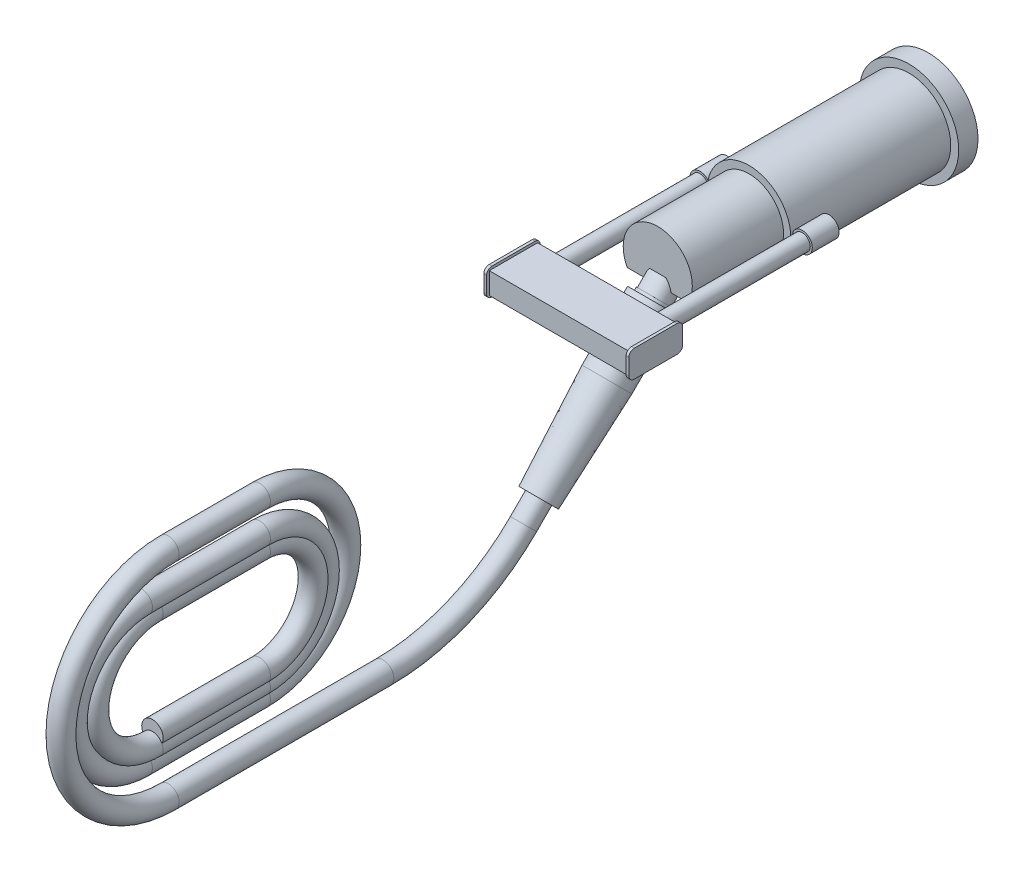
ISO-10303-21;
HEADER;
FILE_DESCRIPTION(('STEP AP214'),'2;1');
FILE_NAME('part.step','',(''),(''),'','','');
FILE_SCHEMA(('AUTOMOTIVE_DESIGN { 1 0 10303 214 1 1 1 1 }'));
ENDSEC;
DATA;
#1=APPLICATION_CONTEXT('core data for automotive mechanical design processes');
#2=APPLICATION_PROTOCOL_DEFINITION('international standard','automotive_design',2000,#1);
#3=PRODUCT_CONTEXT('',#1,'mechanical');
#4=PRODUCT('Part','Part','',(#3));
#5=PRODUCT_RELATED_PRODUCT_CATEGORY('part','',(#4));
#6=PRODUCT_DEFINITION_FORMATION('','',#4);
#7=PRODUCT_DEFINITION_CONTEXT('part definition',#1,'design');
#8=PRODUCT_DEFINITION('design','',#6,#7);
#9=PRODUCT_DEFINITION_SHAPE('','',#8);
#10=(LENGTH_UNIT() NAMED_UNIT(*) SI_UNIT(.MILLI.,.METRE.));
#11=(NAMED_UNIT(*) PLANE_ANGLE_UNIT() SI_UNIT($,.RADIAN.));
#12=(NAMED_UNIT(*) SI_UNIT($,.STERADIAN.) SOLID_ANGLE_UNIT());
#13=UNCERTAINTY_MEASURE_WITH_UNIT(LENGTH_MEASURE(1.E-05),#10,'distance_accuracy_value','');
#14=(GEOMETRIC_REPRESENTATION_CONTEXT(3) GLOBAL_UNCERTAINTY_ASSIGNED_CONTEXT((#13)) GLOBAL_UNIT_ASSIGNED_CONTEXT((#10,
#11,#12)) REPRESENTATION_CONTEXT('',''));
#15=CARTESIAN_POINT('',(0.,0.,0.));
#16=DIRECTION('',(0.,0.,1.));
#17=DIRECTION('',(1.,0.,0.));
#18=AXIS2_PLACEMENT_3D('',#15,#16,#17);
#19=CARTESIAN_POINT('',(0.,-166.776825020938,460.959755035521));
#20=DIRECTION('',(0.,0.707106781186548,-0.707106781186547));
#21=DIRECTION('',(0.,0.707106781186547,0.707106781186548));
#22=AXIS2_PLACEMENT_3D('',#19,#20,#21);
#23=PLANE('',#22);
#24=CARTESIAN_POINT('',(0.,-166.776825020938,460.959755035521));
#25=DIRECTION('',(0.,-0.707106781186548,0.707106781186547));
#26=DIRECTION('',(0.,-0.707106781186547,-0.707106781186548));
#27=AXIS2_PLACEMENT_3D('',#24,#25,#26);
#28=CIRCLE('',#27,19.1395542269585);
#29=CARTESIAN_POINT('',(0.,-180.310533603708,447.426046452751));
#30=VERTEX_POINT('',#29);
#31=EDGE_CURVE('E38',#30,#30,#28,.T.);
#32=ORIENTED_EDGE('',*,*,#31,.T.);
#33=EDGE_LOOP('',(#32));
#34=FACE_BOUND('',#33,.T.);
#35=CARTESIAN_POINT('',(0.,-166.776825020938,460.959755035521));
#36=DIRECTION('',(0.,-0.707106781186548,0.707106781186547));
#37=DIRECTION('',(0.,-0.707106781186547,-0.707106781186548));
#38=AXIS2_PLACEMENT_3D('',#35,#36,#37);
#39=CIRCLE('',#38,12.7);
#40=CARTESIAN_POINT('',(0.,-175.757081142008,451.979498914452));
#41=VERTEX_POINT('',#40);
#42=EDGE_CURVE('E11',#41,#41,#39,.T.);
#43=ORIENTED_EDGE('',*,*,#42,.F.);
#44=EDGE_LOOP('',(#43));
#45=FACE_BOUND('',#44,.T.);
#46=ADVANCED_FACE('F35',(#34,#45),#23,.F.);
#47=CARTESIAN_POINT('',(0.,-85.9545199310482,380.137449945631));
#48=DIRECTION('',(0.,0.707106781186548,-0.707106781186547));
#49=DIRECTION('',(0.,0.707106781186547,0.707106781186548));
#50=AXIS2_PLACEMENT_3D('',#47,#48,#49);
#51=CONICAL_SURFACE('',#50,24.1299999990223,0.0436332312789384);
#52=ORIENTED_EDGE('',*,*,#31,.F.);
#53=EDGE_LOOP('',(#52));
#54=FACE_BOUND('',#53,.T.);
#55=CARTESIAN_POINT('',(0.,-85.9545199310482,380.137449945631));
#56=DIRECTION('',(0.,-0.707106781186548,0.707106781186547));
#57=DIRECTION('',(0.,-0.707106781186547,-0.707106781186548));
#58=AXIS2_PLACEMENT_3D('',#55,#56,#57);
#59=CIRCLE('',#58,24.1299999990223);
#60=CARTESIAN_POINT('',(0.,-103.017006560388,363.074963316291));
#61=VERTEX_POINT('',#60);
#62=EDGE_CURVE('E46',#61,#61,#59,.T.);
#63=ORIENTED_EDGE('',*,*,#62,.T.);
#64=EDGE_LOOP('',(#63));
#65=FACE_BOUND('',#64,.T.);
#66=ADVANCED_FACE('F110',(#54,#65),#51,.T.);
#67=CARTESIAN_POINT('',(0.,-16.3575349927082,310.540465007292));
#68=DIRECTION('',(0.,-0.707106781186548,0.707106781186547));
#69=DIRECTION('',(0.,-0.707106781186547,-0.707106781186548));
#70=AXIS2_PLACEMENT_3D('',#67,#68,#69);
#71=CYLINDRICAL_SURFACE('',#70,24.1299999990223);
#72=ORIENTED_EDGE('',*,*,#62,.F.);
#73=EDGE_LOOP('',(#72));
#74=FACE_BOUND('',#73,.T.);
#75=CARTESIAN_POINT('',(0.,-32.0729832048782,326.255913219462));
#76=DIRECTION('',(0.,-0.707106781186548,0.707106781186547));
#77=DIRECTION('',(0.,-0.707106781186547,-0.707106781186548));
#78=AXIS2_PLACEMENT_3D('',#75,#76,#77);
#79=CIRCLE('',#78,24.1299999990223);
#80=CARTESIAN_POINT('',(0.,-49.1354698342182,309.193426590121));
#81=VERTEX_POINT('',#80);
#82=EDGE_CURVE('E105',#81,#81,#79,.T.);
#83=ORIENTED_EDGE('',*,*,#82,.T.);
#84=EDGE_LOOP('',(#83));
#85=FACE_BOUND('',#84,.T.);
#86=ADVANCED_FACE('F112',(#74,#85),#71,.T.);
#87=CARTESIAN_POINT('',(0.,-19.7251310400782,338.603765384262));
#88=DIRECTION('',(0.,-0.707106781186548,0.707106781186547));
#89=DIRECTION('',(0.,-0.707106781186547,-0.707106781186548));
#90=AXIS2_PLACEMENT_3D('',#87,#88,#89);
#91=PLANE('',#90);
#92=ORIENTED_EDGE('',*,*,#82,.F.);
#93=EDGE_LOOP('',(#92));
#94=FACE_BOUND('',#93,.T.);
#95=CARTESIAN_POINT('',(0.,-32.0729832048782,326.255913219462));
#96=DIRECTION('',(0.,-0.707106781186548,0.707106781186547));
#97=DIRECTION('',(0.,-0.707106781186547,-0.707106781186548));
#98=AXIS2_PLACEMENT_3D('',#95,#96,#97);
#99=CIRCLE('',#98,17.4624999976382);
#100=CARTESIAN_POINT('',(0.,-44.4208353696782,313.908061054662));
#101=VERTEX_POINT('',#100);
#102=EDGE_CURVE('E102',#101,#101,#99,.T.);
#103=ORIENTED_EDGE('',*,*,#102,.T.);
#104=EDGE_LOOP('',(#103));
#105=FACE_BOUND('',#104,.T.);
#106=ADVANCED_FACE('F115',(#94,#105),#91,.F.);
#107=CARTESIAN_POINT('',(0.,-16.3575349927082,310.540465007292));
#108=DIRECTION('',(0.,-0.707106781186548,0.707106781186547));
#109=DIRECTION('',(0.,-0.707106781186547,-0.707106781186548));
#110=AXIS2_PLACEMENT_3D('',#107,#108,#109);
#111=CYLINDRICAL_SURFACE('',#110,17.4624999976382);
#112=ORIENTED_EDGE('',*,*,#102,.F.);
#113=EDGE_LOOP('',(#112));
#114=FACE_BOUND('',#113,.T.);
#115=CARTESIAN_POINT('',(0.,-29.8279191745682,324.010849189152));
#116=DIRECTION('',(0.,-0.707106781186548,0.707106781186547));
#117=DIRECTION('',(0.,-0.707106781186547,-0.707106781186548));
#118=AXIS2_PLACEMENT_3D('',#115,#116,#117);
#119=CIRCLE('',#118,17.4624999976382);
#120=CARTESIAN_POINT('',(0.,-42.1757713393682,311.662997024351));
#121=VERTEX_POINT('',#120);
#122=EDGE_CURVE('E99',#121,#121,#119,.T.);
#123=ORIENTED_EDGE('',*,*,#122,.T.);
#124=EDGE_LOOP('',(#123));
#125=FACE_BOUND('',#124,.T.);
#126=ADVANCED_FACE('F121',(#114,#125),#111,.T.);
#127=CARTESIAN_POINT('',(0.,-18.1535862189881,335.685182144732));
#128=DIRECTION('',(0.,-0.707106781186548,0.707106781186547));
#129=DIRECTION('',(0.,-0.707106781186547,-0.707106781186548));
#130=AXIS2_PLACEMENT_3D('',#127,#128,#129);
#131=PLANE('',#130);
#132=ORIENTED_EDGE('',*,*,#122,.F.);
#133=EDGE_LOOP('',(#132));
#134=FACE_BOUND('',#133,.T.);
#135=CARTESIAN_POINT('',(0.,-29.8279191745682,324.010849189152));
#136=DIRECTION('',(0.,-0.707106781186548,0.707106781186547));
#137=DIRECTION('',(0.,-0.707106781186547,-0.707106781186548));
#138=AXIS2_PLACEMENT_3D('',#135,#136,#137);
#139=CIRCLE('',#138,16.5099999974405);
#140=CARTESIAN_POINT('',(0.,-41.5022521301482,312.336516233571));
#141=VERTEX_POINT('',#140);
#142=EDGE_CURVE('E96',#141,#141,#139,.T.);
#143=ORIENTED_EDGE('',*,*,#142,.T.);
#144=EDGE_LOOP('',(#143));
#145=FACE_BOUND('',#144,.T.);
#146=ADVANCED_FACE('F127',(#134,#145),#131,.F.);
#147=CARTESIAN_POINT('',(0.,-16.3575349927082,310.540465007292));
#148=DIRECTION('',(0.,-0.707106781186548,0.707106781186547));
#149=DIRECTION('',(0.,-0.707106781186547,-0.707106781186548));
#150=AXIS2_PLACEMENT_3D('',#147,#148,#149);
#151=CYLINDRICAL_SURFACE('',#150,16.5099999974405);
#152=ORIENTED_EDGE('',*,*,#142,.F.);
#153=EDGE_LOOP('',(#152));
#154=FACE_BOUND('',#153,.T.);
#155=CARTESIAN_POINT('',(0.,-16.3575349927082,310.540465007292));
#156=DIRECTION('',(0.,-0.707106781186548,0.707106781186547));
#157=DIRECTION('',(0.,-0.707106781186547,-0.707106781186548));
#158=AXIS2_PLACEMENT_3D('',#155,#156,#157);
#159=CIRCLE('',#158,16.5099999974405);
#160=CARTESIAN_POINT('',(0.,-28.0318679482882,298.866132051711));
#161=VERTEX_POINT('',#160);
#162=EDGE_CURVE('E93',#161,#161,#159,.T.);
#163=ORIENTED_EDGE('',*,*,#162,.T.);
#164=EDGE_LOOP('',(#163));
#165=FACE_BOUND('',#164,.T.);
#166=ADVANCED_FACE('F133',(#154,#165),#151,.T.);
#167=CARTESIAN_POINT('',(0.,-16.3575349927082,310.540465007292));
#168=DIRECTION('',(0.,-0.707106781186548,0.707106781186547));
#169=DIRECTION('',(0.,-0.707106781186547,-0.707106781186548));
#170=AXIS2_PLACEMENT_3D('',#167,#168,#169);
#171=PLANE('',#170);
#172=ORIENTED_EDGE('',*,*,#162,.F.);
#173=EDGE_LOOP('',(#172));
#174=FACE_BOUND('',#173,.T.);
#175=ADVANCED_FACE('F139',(#174),#171,.F.);
#176=CARTESIAN_POINT('',(0.,-178.181195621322,791.009849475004));
#177=DIRECTION('',(0.,0.,1.));
#178=DIRECTION('',(0.,-1.,0.));
#179=AXIS2_PLACEMENT_3D('',#176,#177,#178);
#180=CYLINDRICAL_SURFACE('',#179,12.7);
#181=CARTESIAN_POINT('',(0.,-178.181195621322,791.009849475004));
#182=DIRECTION('',(0.,0.,1.));
#183=DIRECTION('',(0.,-1.,0.));
#184=AXIS2_PLACEMENT_3D('',#181,#182,#183);
#185=CIRCLE('',#184,12.7);
#186=CARTESIAN_POINT('',(0.,-190.881195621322,791.009849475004));
#187=VERTEX_POINT('',#186);
#188=EDGE_CURVE('E87',#187,#187,#185,.T.);
#189=ORIENTED_EDGE('',*,*,#188,.T.);
#190=EDGE_LOOP('',(#189));
#191=FACE_BOUND('',#190,.T.);
#192=CARTESIAN_POINT('',(0.,-178.181195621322,918.009849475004));
#193=DIRECTION('',(0.,0.,1.));
#194=DIRECTION('',(0.,-1.,0.));
#195=AXIS2_PLACEMENT_3D('',#192,#193,#194);
#196=CIRCLE('',#195,12.7);
#197=CARTESIAN_POINT('',(0.,-190.881195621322,918.009849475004));
#198=VERTEX_POINT('',#197);
#199=EDGE_CURVE('E90',#198,#198,#196,.T.);
#200=ORIENTED_EDGE('',*,*,#199,.F.);
#201=EDGE_LOOP('',(#200));
#202=FACE_BOUND('',#201,.T.);
#203=ADVANCED_FACE('F144',(#191,#202),#180,.T.);
#204=CARTESIAN_POINT('',(0.,-114.681195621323,791.009849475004));
#205=DIRECTION('',(-1.,0.,0.));
#206=DIRECTION('',(0.,0.,1.));
#207=AXIS2_PLACEMENT_3D('',#204,#205,#206);
#208=TOROIDAL_SURFACE('',#207,63.5,12.7);
#209=CARTESIAN_POINT('',(0.,-51.1811956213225,791.009849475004));
#210=DIRECTION('',(0.,0.,-1.));
#211=DIRECTION('',(0.,1.,0.));
#212=AXIS2_PLACEMENT_3D('',#209,#210,#211);
#213=CIRCLE('',#212,12.7);
#214=CARTESIAN_POINT('',(0.,-38.4811956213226,791.009849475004));
#215=VERTEX_POINT('',#214);
#216=EDGE_CURVE('E84',#215,#215,#213,.T.);
#217=CARTESIAN_POINT('',(0.,-114.681195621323,791.009849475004));
#218=DIRECTION('',(-1.,0.,0.));
#219=DIRECTION('',(0.,0.,1.));
#220=AXIS2_PLACEMENT_3D('',#217,#218,#219);
#221=CIRCLE('',#220,76.2);
#222=EDGE_CURVE('',#215,#187,#221,.T.);
#223=ORIENTED_EDGE('',*,*,#216,.T.);
#224=ORIENTED_EDGE('',*,*,#188,.F.);
#225=ORIENTED_EDGE('',*,*,#222,.T.);
#226=ORIENTED_EDGE('',*,*,#222,.F.);
#227=EDGE_LOOP('',(#223,#225,#224,#226));
#228=FACE_BOUND('',#227,.T.);
#229=ADVANCED_FACE('F150',(#228),#208,.T.);
#230=CARTESIAN_POINT('',(0.,-51.1811956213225,918.009849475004));
#231=DIRECTION('',(0.,0.,-1.));
#232=DIRECTION('',(-1.,0.,0.));
#233=AXIS2_PLACEMENT_3D('',#230,#231,#232);
#234=CYLINDRICAL_SURFACE('',#233,12.7);
#235=CARTESIAN_POINT('',(0.,-51.1811956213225,918.009849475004));
#236=DIRECTION('',(0.,0.,-1.));
#237=DIRECTION('',(0.,1.,0.));
#238=AXIS2_PLACEMENT_3D('',#235,#236,#237);
#239=CIRCLE('',#238,12.7);
#240=CARTESIAN_POINT('',(0.,-38.4811956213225,918.009849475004));
#241=VERTEX_POINT('',#240);
#242=EDGE_CURVE('E81',#241,#241,#239,.T.);
#243=ORIENTED_EDGE('',*,*,#242,.T.);
#244=EDGE_LOOP('',(#243));
#245=FACE_BOUND('',#244,.T.);
#246=ORIENTED_EDGE('',*,*,#216,.F.);
#247=EDGE_LOOP('',(#246));
#248=FACE_BOUND('',#247,.T.);
#249=ADVANCED_FACE('F197',(#245,#248),#234,.T.);
#250=CARTESIAN_POINT('',(0.,-120.827535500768,918.009849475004));
#251=DIRECTION('',(-1.,0.,0.));
#252=DIRECTION('',(0.,0.,1.));
#253=AXIS2_PLACEMENT_3D('',#250,#251,#252);
#254=TOROIDAL_SURFACE('',#253,69.6463398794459,12.7);
#255=CARTESIAN_POINT('',(0.,-190.473875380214,918.009849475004));
#256=DIRECTION('',(0.,0.,1.));
#257=DIRECTION('',(0.,-1.,0.));
#258=AXIS2_PLACEMENT_3D('',#255,#256,#257);
#259=CIRCLE('',#258,12.7);
#260=CARTESIAN_POINT('',(0.,-203.173875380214,918.009849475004));
#261=VERTEX_POINT('',#260);
#262=EDGE_CURVE('E78',#261,#261,#259,.T.);
#263=CARTESIAN_POINT('',(0.,-120.827535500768,918.009849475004));
#264=DIRECTION('',(-1.,0.,0.));
#265=DIRECTION('',(0.,0.,1.));
#266=AXIS2_PLACEMENT_3D('',#263,#264,#265);
#267=CIRCLE('',#266,82.3463398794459);
#268=EDGE_CURVE('',#261,#241,#267,.T.);
#269=ORIENTED_EDGE('',*,*,#262,.T.);
#270=ORIENTED_EDGE('',*,*,#242,.F.);
#271=ORIENTED_EDGE('',*,*,#268,.T.);
#272=ORIENTED_EDGE('',*,*,#268,.F.);
#273=EDGE_LOOP('',(#269,#271,#270,#272));
#274=FACE_BOUND('',#273,.T.);
#275=ADVANCED_FACE('F205',(#274),#254,.T.);
#276=CARTESIAN_POINT('',(0.,-190.473875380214,791.009849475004));
#277=DIRECTION('',(0.,0.,1.));
#278=DIRECTION('',(0.,-1.,0.));
#279=AXIS2_PLACEMENT_3D('',#276,#277,#278);
#280=CYLINDRICAL_SURFACE('',#279,12.7);
#281=CARTESIAN_POINT('',(0.,-190.473875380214,791.009849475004));
#282=DIRECTION('',(0.,0.,1.));
#283=DIRECTION('',(0.,-1.,0.));
#284=AXIS2_PLACEMENT_3D('',#281,#282,#283);
#285=CIRCLE('',#284,12.7);
#286=CARTESIAN_POINT('',(0.,-203.173875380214,791.009849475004));
#287=VERTEX_POINT('',#286);
#288=EDGE_CURVE('E75',#287,#287,#285,.T.);
#289=ORIENTED_EDGE('',*,*,#288,.T.);
#290=EDGE_LOOP('',(#289));
#291=FACE_BOUND('',#290,.T.);
#292=ORIENTED_EDGE('',*,*,#262,.F.);
#293=EDGE_LOOP('',(#292));
#294=FACE_BOUND('',#293,.T.);
#295=ADVANCED_FACE('F213',(#291,#294),#280,.T.);
#296=CARTESIAN_POINT('',(0.,-114.273875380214,791.009849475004));
#297=DIRECTION('',(-1.,0.,0.));
#298=DIRECTION('',(0.,0.,1.));
#299=AXIS2_PLACEMENT_3D('',#296,#297,#298);
#300=TOROIDAL_SURFACE('',#299,76.2,12.7);
#301=CARTESIAN_POINT('',(0.,-38.0738753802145,791.009849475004));
#302=DIRECTION('',(0.,0.,-1.));
#303=DIRECTION('',(0.,1.,0.));
#304=AXIS2_PLACEMENT_3D('',#301,#302,#303);
#305=CIRCLE('',#304,12.7);
#306=CARTESIAN_POINT('',(0.,-25.3738753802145,791.009849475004));
#307=VERTEX_POINT('',#306);
#308=EDGE_CURVE('E72',#307,#307,#305,.T.);
#309=CARTESIAN_POINT('',(0.,-114.273875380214,791.009849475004));
#310=DIRECTION('',(-1.,0.,0.));
#311=DIRECTION('',(0.,0.,1.));
#312=AXIS2_PLACEMENT_3D('',#309,#310,#311);
#313=CIRCLE('',#312,88.8999999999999);
#314=EDGE_CURVE('',#307,#287,#313,.T.);
#315=ORIENTED_EDGE('',*,*,#308,.T.);
#316=ORIENTED_EDGE('',*,*,#288,.F.);
#317=ORIENTED_EDGE('',*,*,#314,.T.);
#318=ORIENTED_EDGE('',*,*,#314,.F.);
#319=EDGE_LOOP('',(#315,#317,#316,#318));
#320=FACE_BOUND('',#319,.T.);
#321=ADVANCED_FACE('F221',(#320),#300,.T.);
#322=CARTESIAN_POINT('',(0.,-38.0738753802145,930.709849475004));
#323=DIRECTION('',(0.,0.,-1.));
#324=DIRECTION('',(-1.,0.,0.));
#325=AXIS2_PLACEMENT_3D('',#322,#323,#324);
#326=CYLINDRICAL_SURFACE('',#325,12.7);
#327=CARTESIAN_POINT('',(0.,-38.0738753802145,930.709849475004));
#328=DIRECTION('',(0.,0.,-1.));
#329=DIRECTION('',(0.,1.,0.));
#330=AXIS2_PLACEMENT_3D('',#327,#328,#329);
#331=CIRCLE('',#330,12.7);
#332=CARTESIAN_POINT('',(0.,-25.3738753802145,930.709849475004));
#333=VERTEX_POINT('',#332);
#334=EDGE_CURVE('E69',#333,#333,#331,.T.);
#335=ORIENTED_EDGE('',*,*,#334,.T.);
#336=EDGE_LOOP('',(#335));
#337=FACE_BOUND('',#336,.T.);
#338=ORIENTED_EDGE('',*,*,#308,.F.);
#339=EDGE_LOOP('',(#338));
#340=FACE_BOUND('',#339,.T.);
#341=ADVANCED_FACE('F229',(#337,#340),#326,.T.);
#342=CARTESIAN_POINT('',(0.,-120.412794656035,930.709849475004));
#343=DIRECTION('',(-1.,0.,0.));
#344=DIRECTION('',(0.,0.,1.));
#345=AXIS2_PLACEMENT_3D('',#342,#343,#344);
#346=TOROIDAL_SURFACE('',#345,82.3389192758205,12.7);
#347=CARTESIAN_POINT('',(0.,-202.751713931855,930.709849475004));
#348=DIRECTION('',(0.,0.,1.));
#349=DIRECTION('',(0.,-1.,0.));
#350=AXIS2_PLACEMENT_3D('',#347,#348,#349);
#351=CIRCLE('',#350,12.7);
#352=CARTESIAN_POINT('',(0.,-215.451713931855,930.709849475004));
#353=VERTEX_POINT('',#352);
#354=EDGE_CURVE('E66',#353,#353,#351,.T.);
#355=CARTESIAN_POINT('',(0.,-120.412794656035,930.709849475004));
#356=DIRECTION('',(-1.,0.,0.));
#357=DIRECTION('',(0.,0.,1.));
#358=AXIS2_PLACEMENT_3D('',#355,#356,#357);
#359=CIRCLE('',#358,95.0389192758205);
#360=EDGE_CURVE('',#353,#333,#359,.T.);
#361=ORIENTED_EDGE('',*,*,#354,.T.);
#362=ORIENTED_EDGE('',*,*,#334,.F.);
#363=ORIENTED_EDGE('',*,*,#360,.T.);
#364=ORIENTED_EDGE('',*,*,#360,.F.);
#365=EDGE_LOOP('',(#361,#363,#362,#364));
#366=FACE_BOUND('',#365,.T.);
#367=ADVANCED_FACE('F237',(#366),#346,.T.);
#368=CARTESIAN_POINT('',(0.,-202.751713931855,791.009849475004));
#369=DIRECTION('',(0.,0.,1.));
#370=DIRECTION('',(1.,0.,0.));
#371=AXIS2_PLACEMENT_3D('',#368,#369,#370);
#372=CYLINDRICAL_SURFACE('',#371,12.7);
#373=CARTESIAN_POINT('',(0.,-202.751713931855,791.009849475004));
#374=DIRECTION('',(0.,0.,1.));
#375=DIRECTION('',(0.,-1.,0.));
#376=AXIS2_PLACEMENT_3D('',#373,#374,#375);
#377=CIRCLE('',#376,12.7);
#378=CARTESIAN_POINT('',(0.,-215.451713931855,791.009849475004));
#379=VERTEX_POINT('',#378);
#380=EDGE_CURVE('E63',#379,#379,#377,.T.);
#381=ORIENTED_EDGE('',*,*,#380,.T.);
#382=EDGE_LOOP('',(#381));
#383=FACE_BOUND('',#382,.T.);
#384=ORIENTED_EDGE('',*,*,#354,.F.);
#385=EDGE_LOOP('',(#384));
#386=FACE_BOUND('',#385,.T.);
#387=ADVANCED_FACE('F245',(#383,#386),#372,.T.);
#388=CARTESIAN_POINT('',(0.,-101.151713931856,791.009849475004));
#389=DIRECTION('',(-1.,0.,0.));
#390=DIRECTION('',(0.,0.,1.));
#391=AXIS2_PLACEMENT_3D('',#388,#389,#390);
#392=TOROIDAL_SURFACE('',#391,101.6,12.7);
#393=CARTESIAN_POINT('',(0.,0.448286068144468,791.009849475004));
#394=DIRECTION('',(0.,0.,-1.));
#395=DIRECTION('',(0.,1.,0.));
#396=AXIS2_PLACEMENT_3D('',#393,#394,#395);
#397=CIRCLE('',#396,12.7);
#398=CARTESIAN_POINT('',(0.,13.1482860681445,791.009849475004));
#399=VERTEX_POINT('',#398);
#400=EDGE_CURVE('E60',#399,#399,#397,.T.);
#401=CARTESIAN_POINT('',(0.,-101.151713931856,791.009849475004));
#402=DIRECTION('',(-1.,0.,0.));
#403=DIRECTION('',(0.,0.,1.));
#404=AXIS2_PLACEMENT_3D('',#401,#402,#403);
#405=CIRCLE('',#404,114.3);
#406=EDGE_CURVE('',#399,#379,#405,.T.);
#407=ORIENTED_EDGE('',*,*,#400,.T.);
#408=ORIENTED_EDGE('',*,*,#380,.F.);
#409=ORIENTED_EDGE('',*,*,#406,.T.);
#410=ORIENTED_EDGE('',*,*,#406,.F.);
#411=EDGE_LOOP('',(#407,#409,#408,#410));
#412=FACE_BOUND('',#411,.T.);
#413=ADVANCED_FACE('F253',(#412),#392,.T.);
#414=CARTESIAN_POINT('',(0.,0.448286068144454,899.052868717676));
#415=DIRECTION('',(0.,0.,-1.));
#416=DIRECTION('',(0.,1.,0.));
#417=AXIS2_PLACEMENT_3D('',#414,#415,#416);
#418=CYLINDRICAL_SURFACE('',#417,12.7);
#419=CARTESIAN_POINT('',(0.,0.448286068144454,899.052868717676));
#420=DIRECTION('',(0.,0.,-1.));
#421=DIRECTION('',(0.,1.,0.));
#422=AXIS2_PLACEMENT_3D('',#419,#420,#421);
#423=CIRCLE('',#422,12.7);
#424=CARTESIAN_POINT('',(0.,13.1482860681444,899.052868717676));
#425=VERTEX_POINT('',#424);
#426=EDGE_CURVE('E57',#425,#425,#423,.T.);
#427=CARTESIAN_POINT('',(0.,13.1482860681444,899.052868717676));
#428=CARTESIAN_POINT('',(0.,13.1482860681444,897.927420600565));
#429=CARTESIAN_POINT('',(0.,13.1482860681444,896.801972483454));
#430=CARTESIAN_POINT('',(0.,13.1482860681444,894.551076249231));
#431=CARTESIAN_POINT('',(0.,13.1482860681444,893.42562813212));
#432=CARTESIAN_POINT('',(0.,13.1482860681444,891.174731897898));
#433=CARTESIAN_POINT('',(0.,13.1482860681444,890.049283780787));
#434=CARTESIAN_POINT('',(0.,13.1482860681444,887.798387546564));
#435=CARTESIAN_POINT('',(0.,13.1482860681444,886.672939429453));
#436=CARTESIAN_POINT('',(0.,13.1482860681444,884.422043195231));
#437=CARTESIAN_POINT('',(0.,13.1482860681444,883.29659507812));
#438=CARTESIAN_POINT('',(0.,13.1482860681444,881.045698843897));
#439=CARTESIAN_POINT('',(0.,13.1482860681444,879.920250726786));
#440=CARTESIAN_POINT('',(0.,13.1482860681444,877.669354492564));
#441=CARTESIAN_POINT('',(0.,13.1482860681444,876.543906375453));
#442=CARTESIAN_POINT('',(0.,13.1482860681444,874.29301014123));
#443=CARTESIAN_POINT('',(0.,13.1482860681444,873.167562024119));
#444=CARTESIAN_POINT('',(0.,13.1482860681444,870.916665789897));
#445=CARTESIAN_POINT('',(0.,13.1482860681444,869.791217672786));
#446=CARTESIAN_POINT('',(0.,13.1482860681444,867.540321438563));
#447=CARTESIAN_POINT('',(0.,13.1482860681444,866.414873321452));
#448=CARTESIAN_POINT('',(0.,13.1482860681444,864.16397708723));
#449=CARTESIAN_POINT('',(0.,13.1482860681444,863.038528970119));
#450=CARTESIAN_POINT('',(0.,13.1482860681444,860.787632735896));
#451=CARTESIAN_POINT('',(0.,13.1482860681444,859.662184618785));
#452=CARTESIAN_POINT('',(0.,13.1482860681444,857.411288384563));
#453=CARTESIAN_POINT('',(0.,13.1482860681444,856.285840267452));
#454=CARTESIAN_POINT('',(0.,13.1482860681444,854.034944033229));
#455=CARTESIAN_POINT('',(0.,13.1482860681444,852.909495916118));
#456=CARTESIAN_POINT('',(0.,13.1482860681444,850.658599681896));
#457=CARTESIAN_POINT('',(0.,13.1482860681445,849.533151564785));
#458=CARTESIAN_POINT('',(0.,13.1482860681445,847.282255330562));
#459=CARTESIAN_POINT('',(0.,13.1482860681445,846.156807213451));
#460=CARTESIAN_POINT('',(0.,13.1482860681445,843.905910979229));
#461=CARTESIAN_POINT('',(0.,13.1482860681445,842.780462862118));
#462=CARTESIAN_POINT('',(0.,13.1482860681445,840.529566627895));
#463=CARTESIAN_POINT('',(0.,13.1482860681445,839.404118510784));
#464=CARTESIAN_POINT('',(0.,13.1482860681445,837.153222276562));
#465=CARTESIAN_POINT('',(0.,13.1482860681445,836.027774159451));
#466=CARTESIAN_POINT('',(0.,13.1482860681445,833.776877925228));
#467=CARTESIAN_POINT('',(0.,13.1482860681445,832.651429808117));
#468=CARTESIAN_POINT('',(0.,13.1482860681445,830.400533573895));
#469=CARTESIAN_POINT('',(0.,13.1482860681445,829.275085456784));
#470=CARTESIAN_POINT('',(0.,13.1482860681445,827.024189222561));
#471=CARTESIAN_POINT('',(0.,13.1482860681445,825.89874110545));
#472=CARTESIAN_POINT('',(0.,13.1482860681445,823.647844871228));
#473=CARTESIAN_POINT('',(0.,13.1482860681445,822.522396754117));
#474=CARTESIAN_POINT('',(0.,13.1482860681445,820.271500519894));
#475=CARTESIAN_POINT('',(0.,13.1482860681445,819.146052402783));
#476=CARTESIAN_POINT('',(0.,13.1482860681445,816.895156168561));
#477=CARTESIAN_POINT('',(0.,13.1482860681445,815.76970805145));
#478=CARTESIAN_POINT('',(0.,13.1482860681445,813.518811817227));
#479=CARTESIAN_POINT('',(0.,13.1482860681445,812.393363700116));
#480=CARTESIAN_POINT('',(0.,13.1482860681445,810.142467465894));
#481=CARTESIAN_POINT('',(0.,13.1482860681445,809.017019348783));
#482=CARTESIAN_POINT('',(0.,13.1482860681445,806.76612311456));
#483=CARTESIAN_POINT('',(0.,13.1482860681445,805.640674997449));
#484=CARTESIAN_POINT('',(0.,13.1482860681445,803.389778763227));
#485=CARTESIAN_POINT('',(0.,13.1482860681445,802.264330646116));
#486=CARTESIAN_POINT('',(0.,13.1482860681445,800.013434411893));
#487=CARTESIAN_POINT('',(0.,13.1482860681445,798.887986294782));
#488=CARTESIAN_POINT('',(0.,13.1482860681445,796.63709006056));
#489=CARTESIAN_POINT('',(0.,13.1482860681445,795.511641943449));
#490=CARTESIAN_POINT('',(0.,13.1482860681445,793.260745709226));
#491=CARTESIAN_POINT('',(0.,13.1482860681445,792.135297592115));
#492=CARTESIAN_POINT('',(0.,13.1482860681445,791.009849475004));
#493=B_SPLINE_CURVE_WITH_KNOTS('',3,(#427,#428,#429,#430,#431,#432,#433,#434,#435,#436,#437,
#438,#439,#440,#441,#442,#443,#444,#445,#446,#447,#448,#449,#450,#451,#452,#453,#454,#455,#456,
#457,#458,#459,#460,#461,#462,#463,#464,#465,#466,#467,#468,#469,#470,#471,#472,#473,#474,#475,
#476,#477,#478,#479,#480,#481,#482,#483,#484,#485,#486,#487,#488,#489,#490,#491,#492),
.UNSPECIFIED.,.F.,.F.,(4,2,2,2,2,2,2,2,2,2,2,2,2,2,2,2,2,2,2,2,2,2,2,2,2,2,2,2,2,2,2,2,4),(0.,
3.37634435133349,6.75268870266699,10.1290330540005,13.505377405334,16.8817217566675,
20.258066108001,23.6344104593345,27.0107548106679,30.3870991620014,33.7634435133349,
37.1397878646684,40.5161322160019,43.8924765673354,47.2688209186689,50.6451652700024,
54.0215096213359,57.3978539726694,60.774198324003,64.1505426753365,67.52688702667,
70.9032313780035,74.279575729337,77.6559200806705,81.032264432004,84.4086087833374,
87.7849531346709,91.1612974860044,94.5376418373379,97.9139861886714,101.290330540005,
104.666674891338,108.043019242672),.UNSPECIFIED.);
#494=EDGE_CURVE('BSEAM261',#425,#399,#493,.T.);
#495=ORIENTED_EDGE('',*,*,#426,.T.);
#496=ORIENTED_EDGE('',*,*,#400,.F.);
#497=ORIENTED_EDGE('',*,*,#494,.T.);
#498=ORIENTED_EDGE('',*,*,#494,.F.);
#499=EDGE_LOOP('',(#495,#497,#496,#498));
#500=FACE_BOUND('',#499,.T.);
#501=ADVANCED_FACE('F261',(#500),#418,.T.);
#502=CARTESIAN_POINT('',(0.,-126.551713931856,899.052868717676));
#503=DIRECTION('',(-1.,0.,0.));
#504=DIRECTION('',(0.,0.,1.));
#505=AXIS2_PLACEMENT_3D('',#502,#503,#504);
#506=TOROIDAL_SURFACE('',#505,127.,12.7);
#507=CARTESIAN_POINT('',(0.,-253.551713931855,899.052868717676));
#508=DIRECTION('',(0.,0.,1.));
#509=DIRECTION('',(0.,-1.,0.));
#510=AXIS2_PLACEMENT_3D('',#507,#508,#509);
#511=CIRCLE('',#510,12.7);
#512=CARTESIAN_POINT('',(0.,-266.251713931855,899.052868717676));
#513=VERTEX_POINT('',#512);
#514=EDGE_CURVE('E54',#513,#513,#511,.T.);
#515=CARTESIAN_POINT('',(0.,-126.551713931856,899.052868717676));
#516=DIRECTION('',(-1.,0.,0.));
#517=DIRECTION('',(0.,0.,1.));
#518=AXIS2_PLACEMENT_3D('',#515,#516,#517);
#519=CIRCLE('',#518,139.7);
#520=EDGE_CURVE('',#513,#425,#519,.T.);
#521=ORIENTED_EDGE('',*,*,#514,.T.);
#522=ORIENTED_EDGE('',*,*,#426,.F.);
#523=ORIENTED_EDGE('',*,*,#520,.T.);
#524=ORIENTED_EDGE('',*,*,#520,.F.);
#525=EDGE_LOOP('',(#521,#523,#522,#524));
#526=FACE_BOUND('',#525,.T.);
#527=ADVANCED_FACE('F269',(#526),#506,.T.);
#528=CARTESIAN_POINT('',(0.,-253.551713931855,645.052868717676));
#529=DIRECTION('',(0.,0.,1.));
#530=DIRECTION('',(1.,0.,0.));
#531=AXIS2_PLACEMENT_3D('',#528,#529,#530);
#532=CYLINDRICAL_SURFACE('',#531,12.7);
#533=CARTESIAN_POINT('',(0.,-253.551713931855,645.052868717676));
#534=DIRECTION('',(0.,0.,1.));
#535=DIRECTION('',(0.,-1.,0.));
#536=AXIS2_PLACEMENT_3D('',#533,#534,#535);
#537=CIRCLE('',#536,12.7);
#538=CARTESIAN_POINT('',(0.,-266.251713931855,645.052868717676));
#539=VERTEX_POINT('',#538);
#540=EDGE_CURVE('E51',#539,#539,#537,.T.);
#541=ORIENTED_EDGE('',*,*,#540,.T.);
#542=EDGE_LOOP('',(#541));
#543=FACE_BOUND('',#542,.T.);
#544=ORIENTED_EDGE('',*,*,#514,.F.);
#545=EDGE_LOOP('',(#544));
#546=FACE_BOUND('',#545,.T.);
#547=ADVANCED_FACE('F277',(#543,#546),#532,.T.);
#548=CARTESIAN_POINT('',(0.,-18.6047358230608,645.052868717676));
#549=DIRECTION('',(-1.,0.,0.));
#550=DIRECTION('',(0.,0.,1.));
#551=AXIS2_PLACEMENT_3D('',#548,#549,#550);
#552=TOROIDAL_SURFACE('',#551,234.946978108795,12.7);
#553=CARTESIAN_POINT('',(0.,-184.737337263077,478.92026727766));
#554=DIRECTION('',(0.,-0.707106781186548,0.707106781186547));
#555=DIRECTION('',(0.,-0.707106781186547,-0.707106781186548));
#556=AXIS2_PLACEMENT_3D('',#553,#554,#555);
#557=CIRCLE('',#556,12.7);
#558=CARTESIAN_POINT('',(0.,-193.717593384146,469.940011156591));
#559=VERTEX_POINT('',#558);
#560=EDGE_CURVE('E48',#559,#559,#557,.T.);
#561=CARTESIAN_POINT('',(0.,-18.6047358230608,645.052868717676));
#562=DIRECTION('',(-1.,0.,0.));
#563=DIRECTION('',(0.,0.,1.));
#564=AXIS2_PLACEMENT_3D('',#561,#562,#563);
#565=CIRCLE('',#564,247.646978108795);
#566=EDGE_CURVE('',#559,#539,#565,.T.);
#567=ORIENTED_EDGE('',*,*,#560,.T.);
#568=ORIENTED_EDGE('',*,*,#540,.F.);
#569=ORIENTED_EDGE('',*,*,#566,.T.);
#570=ORIENTED_EDGE('',*,*,#566,.F.);
#571=EDGE_LOOP('',(#567,#569,#568,#570));
#572=FACE_BOUND('',#571,.T.);
#573=ADVANCED_FACE('F285',(#572),#552,.T.);
#574=CARTESIAN_POINT('',(0.,-184.737337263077,478.92026727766));
#575=DIRECTION('',(0.,0.707106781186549,-0.707106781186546));
#576=DIRECTION('',(0.,0.707106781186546,0.707106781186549));
#577=AXIS2_PLACEMENT_3D('',#574,#575,#576);
#578=CYLINDRICAL_SURFACE('',#577,12.7);
#579=ORIENTED_EDGE('',*,*,#560,.F.);
#580=EDGE_LOOP('',(#579));
#581=FACE_BOUND('',#580,.T.);
#582=ORIENTED_EDGE('',*,*,#42,.T.);
#583=EDGE_LOOP('',(#582));
#584=FACE_BOUND('',#583,.T.);
#585=ADVANCED_FACE('F293',(#581,#584),#578,.T.);
#586=CARTESIAN_POINT('',(0.,-178.181195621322,918.009849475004));
#587=DIRECTION('',(0.,0.,1.));
#588=DIRECTION('',(0.,-1.,0.));
#589=AXIS2_PLACEMENT_3D('',#586,#587,#588);
#590=PLANE('',#589);
#591=ORIENTED_EDGE('',*,*,#199,.T.);
#592=EDGE_LOOP('',(#591));
#593=FACE_BOUND('',#592,.T.);
#594=ADVANCED_FACE('F301',(#593),#590,.T.);
#595=CLOSED_SHELL('',(#46,#66,#86,#106,#126,#146,#166,#175,#203,#229,#249,#275,#295,#321,#341,
#367,#387,#413,#501,#527,#547,#573,#585,#594));
#596=MANIFOLD_SOLID_BREP('B2',#595);
#597=CARTESIAN_POINT('',(-85.852,9.525,433.705));
#598=DIRECTION('',(1.,0.,0.));
#599=DIRECTION('',(0.,0.,1.));
#600=AXIS2_PLACEMENT_3D('',#597,#598,#599);
#601=CYLINDRICAL_SURFACE('',#600,6.34999999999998);
#602=CARTESIAN_POINT('',(-82.55,9.525,433.705));
#603=DIRECTION('',(1.,0.,0.));
#604=DIRECTION('',(0.,0.,1.));
#605=AXIS2_PLACEMENT_3D('',#602,#603,#604);
#606=CIRCLE('',#605,6.34999999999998);
#607=CARTESIAN_POINT('',(-82.55,15.875,433.705));
#608=VERTEX_POINT('',#607);
#609=CARTESIAN_POINT('',(-82.55,9.525,440.055));
#610=VERTEX_POINT('',#609);
#611=EDGE_CURVE('E422',#608,#610,#606,.T.);
#612=ORIENTED_EDGE('',*,*,#611,.F.);
#613=DIRECTION('',(1.,0.,0.));
#614=VECTOR('',#613,1.);
#615=CARTESIAN_POINT('',(-85.852,15.875,433.705));
#616=LINE('',#615,#614);
#617=CARTESIAN_POINT('',(-85.852,15.875,433.705));
#618=VERTEX_POINT('',#617);
#619=EDGE_CURVE('E465',#618,#608,#616,.T.);
#620=ORIENTED_EDGE('',*,*,#619,.F.);
#621=CARTESIAN_POINT('',(-85.852,9.525,433.705));
#622=DIRECTION('',(1.,0.,0.));
#623=DIRECTION('',(0.,0.,1.));
#624=AXIS2_PLACEMENT_3D('',#621,#622,#623);
#625=CIRCLE('',#624,6.34999999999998);
#626=CARTESIAN_POINT('',(-85.852,9.525,440.055));
#627=VERTEX_POINT('',#626);
#628=EDGE_CURVE('E427',#618,#627,#625,.T.);
#629=ORIENTED_EDGE('',*,*,#628,.T.);
#630=DIRECTION('',(1.,0.,0.));
#631=VECTOR('',#630,1.);
#632=CARTESIAN_POINT('',(-85.852,9.525,440.055));
#633=LINE('',#632,#631);
#634=EDGE_CURVE('E33',#627,#610,#633,.T.);
#635=ORIENTED_EDGE('',*,*,#634,.T.);
#636=EDGE_LOOP('',(#612,#620,#629,#635));
#637=FACE_BOUND('',#636,.T.);
#638=ADVANCED_FACE('F350',(#637),#601,.T.);
#639=CARTESIAN_POINT('',(-85.852,9.525,440.055));
#640=DIRECTION('',(0.,0.,-1.));
#641=DIRECTION('',(1.,0.,0.));
#642=AXIS2_PLACEMENT_3D('',#639,#640,#641);
#643=PLANE('',#642);
#644=DIRECTION('',(0.,-1.,0.));
#645=VECTOR('',#644,1.);
#646=CARTESIAN_POINT('',(-82.55,9.525,440.055));
#647=LINE('',#646,#645);
#648=CARTESIAN_POINT('',(-82.55,-9.525,440.055));
#649=VERTEX_POINT('',#648);
#650=EDGE_CURVE('E413',#610,#649,#647,.T.);
#651=ORIENTED_EDGE('',*,*,#650,.F.);
#652=ORIENTED_EDGE('',*,*,#634,.F.);
#653=DIRECTION('',(0.,-1.,0.));
#654=VECTOR('',#653,1.);
#655=CARTESIAN_POINT('',(-85.852,9.525,440.055));
#656=LINE('',#655,#654);
#657=CARTESIAN_POINT('',(-85.852,-9.525,440.055));
#658=VERTEX_POINT('',#657);
#659=EDGE_CURVE('E447',#627,#658,#656,.T.);
#660=ORIENTED_EDGE('',*,*,#659,.T.);
#661=DIRECTION('',(1.,0.,0.));
#662=VECTOR('',#661,1.);
#663=CARTESIAN_POINT('',(-85.852,-9.525,440.055));
#664=LINE('',#663,#662);
#665=EDGE_CURVE('E357',#658,#649,#664,.T.);
#666=ORIENTED_EDGE('',*,*,#665,.T.);
#667=EDGE_LOOP('',(#651,#652,#660,#666));
#668=FACE_BOUND('',#667,.T.);
#669=ADVANCED_FACE('F414',(#668),#643,.F.);
#670=CARTESIAN_POINT('',(-85.852,-9.525,433.705));
#671=DIRECTION('',(1.,0.,0.));
#672=DIRECTION('',(0.,0.,1.));
#673=AXIS2_PLACEMENT_3D('',#670,#671,#672);
#674=CYLINDRICAL_SURFACE('',#673,6.34999999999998);
#675=CARTESIAN_POINT('',(-82.55,-9.525,433.705));
#676=DIRECTION('',(1.,0.,0.));
#677=DIRECTION('',(0.,0.,-1.));
#678=AXIS2_PLACEMENT_3D('',#675,#676,#677);
#679=CIRCLE('',#678,6.34999999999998);
#680=CARTESIAN_POINT('',(-82.55,-15.875,433.705));
#681=VERTEX_POINT('',#680);
#682=EDGE_CURVE('E421',#649,#681,#679,.T.);
#683=ORIENTED_EDGE('',*,*,#682,.F.);
#684=ORIENTED_EDGE('',*,*,#665,.F.);
#685=CARTESIAN_POINT('',(-85.852,-9.525,433.705));
#686=DIRECTION('',(1.,0.,0.));
#687=DIRECTION('',(0.,0.,-1.));
#688=AXIS2_PLACEMENT_3D('',#685,#686,#687);
#689=CIRCLE('',#688,6.34999999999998);
#690=CARTESIAN_POINT('',(-85.852,-15.875,433.705));
#691=VERTEX_POINT('',#690);
#692=EDGE_CURVE('E449',#658,#691,#689,.T.);
#693=ORIENTED_EDGE('',*,*,#692,.T.);
#694=DIRECTION('',(1.,0.,0.));
#695=VECTOR('',#694,1.);
#696=CARTESIAN_POINT('',(-85.852,-15.875,433.705));
#697=LINE('',#696,#695);
#698=EDGE_CURVE('E479',#691,#681,#697,.T.);
#699=ORIENTED_EDGE('',*,*,#698,.T.);
#700=EDGE_LOOP('',(#683,#684,#693,#699));
#701=FACE_BOUND('',#700,.T.);
#702=ADVANCED_FACE('F483',(#701),#674,.T.);
#703=CARTESIAN_POINT('',(-85.852,-15.875,433.705));
#704=DIRECTION('',(0.,1.,0.));
#705=DIRECTION('',(0.,0.,1.));
#706=AXIS2_PLACEMENT_3D('',#703,#704,#705);
#707=PLANE('',#706);
#708=DIRECTION('',(0.,0.,-1.));
#709=VECTOR('',#708,1.);
#710=CARTESIAN_POINT('',(-82.55,-15.875,433.705));
#711=LINE('',#710,#709);
#712=CARTESIAN_POINT('',(-82.55,-15.875,382.905));
#713=VERTEX_POINT('',#712);
#714=EDGE_CURVE('E434',#681,#713,#711,.T.);
#715=ORIENTED_EDGE('',*,*,#714,.F.);
#716=ORIENTED_EDGE('',*,*,#698,.F.);
#717=DIRECTION('',(0.,0.,-1.));
#718=VECTOR('',#717,1.);
#719=CARTESIAN_POINT('',(-85.852,-15.875,433.705));
#720=LINE('',#719,#718);
#721=CARTESIAN_POINT('',(-85.852,-15.875,382.905));
#722=VERTEX_POINT('',#721);
#723=EDGE_CURVE('E452',#691,#722,#720,.T.);
#724=ORIENTED_EDGE('',*,*,#723,.T.);
#725=DIRECTION('',(1.,0.,0.));
#726=VECTOR('',#725,1.);
#727=CARTESIAN_POINT('',(-85.852,-15.875,382.905));
#728=LINE('',#727,#726);
#729=EDGE_CURVE('E476',#722,#713,#728,.T.);
#730=ORIENTED_EDGE('',*,*,#729,.T.);
#731=EDGE_LOOP('',(#715,#716,#724,#730));
#732=FACE_BOUND('',#731,.T.);
#733=ADVANCED_FACE('F485',(#732),#707,.F.);
#734=CARTESIAN_POINT('',(-85.852,-9.525,382.905));
#735=DIRECTION('',(1.,0.,0.));
#736=DIRECTION('',(0.,0.,1.));
#737=AXIS2_PLACEMENT_3D('',#734,#735,#736);
#738=CYLINDRICAL_SURFACE('',#737,6.35000000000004);
#739=CARTESIAN_POINT('',(-82.55,-9.525,382.905));
#740=DIRECTION('',(1.,0.,0.));
#741=DIRECTION('',(0.,0.,1.));
#742=AXIS2_PLACEMENT_3D('',#739,#740,#741);
#743=CIRCLE('',#742,6.35000000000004);
#744=CARTESIAN_POINT('',(-82.55,-9.525,376.555));
#745=VERTEX_POINT('',#744);
#746=EDGE_CURVE('E437',#713,#745,#743,.T.);
#747=ORIENTED_EDGE('',*,*,#746,.F.);
#748=ORIENTED_EDGE('',*,*,#729,.F.);
#749=CARTESIAN_POINT('',(-85.852,-9.525,382.905));
#750=DIRECTION('',(1.,0.,0.));
#751=DIRECTION('',(0.,0.,1.));
#752=AXIS2_PLACEMENT_3D('',#749,#750,#751);
#753=CIRCLE('',#752,6.35000000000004);
#754=CARTESIAN_POINT('',(-85.852,-9.525,376.555));
#755=VERTEX_POINT('',#754);
#756=EDGE_CURVE('E455',#722,#755,#753,.T.);
#757=ORIENTED_EDGE('',*,*,#756,.T.);
#758=DIRECTION('',(1.,0.,0.));
#759=VECTOR('',#758,1.);
#760=CARTESIAN_POINT('',(-85.852,-9.525,376.555));
#761=LINE('',#760,#759);
#762=EDGE_CURVE('E473',#755,#745,#761,.T.);
#763=ORIENTED_EDGE('',*,*,#762,.T.);
#764=EDGE_LOOP('',(#747,#748,#757,#763));
#765=FACE_BOUND('',#764,.T.);
#766=ADVANCED_FACE('F488',(#765),#738,.T.);
#767=CARTESIAN_POINT('',(-85.852,-9.525,376.555));
#768=DIRECTION('',(0.,0.,1.));
#769=DIRECTION('',(-1.,0.,0.));
#770=AXIS2_PLACEMENT_3D('',#767,#768,#769);
#771=PLANE('',#770);
#772=DIRECTION('',(0.,1.,0.));
#773=VECTOR('',#772,1.);
#774=CARTESIAN_POINT('',(-82.55,-9.525,376.555));
#775=LINE('',#774,#773);
#776=CARTESIAN_POINT('',(-82.55,9.525,376.555));
#777=VERTEX_POINT('',#776);
#778=EDGE_CURVE('E440',#745,#777,#775,.T.);
#779=ORIENTED_EDGE('',*,*,#778,.F.);
#780=ORIENTED_EDGE('',*,*,#762,.F.);
#781=DIRECTION('',(0.,1.,0.));
#782=VECTOR('',#781,1.);
#783=CARTESIAN_POINT('',(-85.852,-9.525,376.555));
#784=LINE('',#783,#782);
#785=CARTESIAN_POINT('',(-85.852,9.525,376.555));
#786=VERTEX_POINT('',#785);
#787=EDGE_CURVE('E458',#755,#786,#784,.T.);
#788=ORIENTED_EDGE('',*,*,#787,.T.);
#789=DIRECTION('',(1.,0.,0.));
#790=VECTOR('',#789,1.);
#791=CARTESIAN_POINT('',(-85.852,9.525,376.555));
#792=LINE('',#791,#790);
#793=EDGE_CURVE('E470',#786,#777,#792,.T.);
#794=ORIENTED_EDGE('',*,*,#793,.T.);
#795=EDGE_LOOP('',(#779,#780,#788,#794));
#796=FACE_BOUND('',#795,.T.);
#797=ADVANCED_FACE('F491',(#796),#771,.F.);
#798=CARTESIAN_POINT('',(-85.852,9.525,382.905));
#799=DIRECTION('',(1.,0.,0.));
#800=DIRECTION('',(0.,0.,1.));
#801=AXIS2_PLACEMENT_3D('',#798,#799,#800);
#802=CYLINDRICAL_SURFACE('',#801,6.35000000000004);
#803=CARTESIAN_POINT('',(-82.55,9.525,382.905));
#804=DIRECTION('',(1.,0.,0.));
#805=DIRECTION('',(0.,0.,1.));
#806=AXIS2_PLACEMENT_3D('',#803,#804,#805);
#807=CIRCLE('',#806,6.35000000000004);
#808=CARTESIAN_POINT('',(-82.55,15.875,382.905));
#809=VERTEX_POINT('',#808);
#810=EDGE_CURVE('E443',#777,#809,#807,.T.);
#811=ORIENTED_EDGE('',*,*,#810,.F.);
#812=ORIENTED_EDGE('',*,*,#793,.F.);
#813=CARTESIAN_POINT('',(-85.852,9.525,382.905));
#814=DIRECTION('',(1.,0.,0.));
#815=DIRECTION('',(0.,0.,1.));
#816=AXIS2_PLACEMENT_3D('',#813,#814,#815);
#817=CIRCLE('',#816,6.35000000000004);
#818=CARTESIAN_POINT('',(-85.852,15.875,382.905));
#819=VERTEX_POINT('',#818);
#820=EDGE_CURVE('E461',#786,#819,#817,.T.);
#821=ORIENTED_EDGE('',*,*,#820,.T.);
#822=DIRECTION('',(1.,0.,0.));
#823=VECTOR('',#822,1.);
#824=CARTESIAN_POINT('',(-85.852,15.875,382.905));
#825=LINE('',#824,#823);
#826=EDGE_CURVE('E467',#819,#809,#825,.T.);
#827=ORIENTED_EDGE('',*,*,#826,.T.);
#828=EDGE_LOOP('',(#811,#812,#821,#827));
#829=FACE_BOUND('',#828,.T.);
#830=ADVANCED_FACE('F494',(#829),#802,.T.);
#831=CARTESIAN_POINT('',(-85.852,15.875,382.905));
#832=DIRECTION('',(0.,-1.,0.));
#833=DIRECTION('',(0.,0.,-1.));
#834=AXIS2_PLACEMENT_3D('',#831,#832,#833);
#835=PLANE('',#834);
#836=DIRECTION('',(0.,0.,1.));
#837=VECTOR('',#836,1.);
#838=CARTESIAN_POINT('',(-82.55,15.875,382.905));
#839=LINE('',#838,#837);
#840=EDGE_CURVE('E430',#809,#608,#839,.T.);
#841=ORIENTED_EDGE('',*,*,#840,.F.);
#842=ORIENTED_EDGE('',*,*,#826,.F.);
#843=DIRECTION('',(0.,0.,1.));
#844=VECTOR('',#843,1.);
#845=CARTESIAN_POINT('',(-85.852,15.875,382.905));
#846=LINE('',#845,#844);
#847=EDGE_CURVE('E364',#819,#618,#846,.T.);
#848=ORIENTED_EDGE('',*,*,#847,.T.);
#849=ORIENTED_EDGE('',*,*,#619,.T.);
#850=EDGE_LOOP('',(#841,#842,#848,#849));
#851=FACE_BOUND('',#850,.T.);
#852=ADVANCED_FACE('F495',(#851),#835,.F.);
#853=CARTESIAN_POINT('',(-85.852,9.525,433.705));
#854=DIRECTION('',(1.,0.,0.));
#855=DIRECTION('',(0.,0.,1.));
#856=AXIS2_PLACEMENT_3D('',#853,#854,#855);
#857=PLANE('',#856);
#858=ORIENTED_EDGE('',*,*,#628,.F.);
#859=ORIENTED_EDGE('',*,*,#847,.F.);
#860=ORIENTED_EDGE('',*,*,#820,.F.);
#861=ORIENTED_EDGE('',*,*,#787,.F.);
#862=ORIENTED_EDGE('',*,*,#756,.F.);
#863=ORIENTED_EDGE('',*,*,#723,.F.);
#864=ORIENTED_EDGE('',*,*,#692,.F.);
#865=ORIENTED_EDGE('',*,*,#659,.F.);
#866=EDGE_LOOP('',(#858,#859,#860,#861,#862,#863,#864,#865));
#867=FACE_BOUND('',#866,.T.);
#868=ADVANCED_FACE('F497',(#867),#857,.F.);
#869=CARTESIAN_POINT('',(-82.55,9.525,433.705));
#870=DIRECTION('',(1.,0.,0.));
#871=DIRECTION('',(0.,0.,1.));
#872=AXIS2_PLACEMENT_3D('',#869,#870,#871);
#873=PLANE('',#872);
#874=ORIENTED_EDGE('',*,*,#611,.T.);
#875=ORIENTED_EDGE('',*,*,#650,.T.);
#876=ORIENTED_EDGE('',*,*,#682,.T.);
#877=ORIENTED_EDGE('',*,*,#714,.T.);
#878=ORIENTED_EDGE('',*,*,#746,.T.);
#879=ORIENTED_EDGE('',*,*,#778,.T.);
#880=ORIENTED_EDGE('',*,*,#810,.T.);
#881=ORIENTED_EDGE('',*,*,#840,.T.);
#882=EDGE_LOOP('',(#874,#875,#876,#877,#878,#879,#880,#881));
#883=FACE_BOUND('',#882,.T.);
#884=ADVANCED_FACE('F428',(#883),#873,.T.);
#885=CLOSED_SHELL('',(#638,#669,#702,#733,#766,#797,#830,#852,#868,#884));
#886=MANIFOLD_SOLID_BREP('B6',#885);
#887=CARTESIAN_POINT('',(-60.452,0.,379.73));
#888=DIRECTION('',(0.,0.,-1.));
#889=DIRECTION('',(1.,0.,0.));
#890=AXIS2_PLACEMENT_3D('',#887,#888,#889);
#891=CYLINDRICAL_SURFACE('',#890,9.52500000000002);
#892=CARTESIAN_POINT('',(-60.452,0.,379.73));
#893=DIRECTION('',(0.,0.,-1.));
#894=DIRECTION('',(-1.,0.,0.));
#895=AXIS2_PLACEMENT_3D('',#892,#893,#894);
#896=CIRCLE('',#895,9.52500000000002);
#897=CARTESIAN_POINT('',(-69.977,0.,379.73));
#898=VERTEX_POINT('',#897);
#899=EDGE_CURVE('E349',#898,#898,#896,.T.);
#900=ORIENTED_EDGE('',*,*,#899,.T.);
#901=EDGE_LOOP('',(#900));
#902=FACE_BOUND('',#901,.T.);
#903=CARTESIAN_POINT('',(-60.452,0.,209.55));
#904=DIRECTION('',(0.,0.,-1.));
#905=DIRECTION('',(-1.,0.,0.));
#906=AXIS2_PLACEMENT_3D('',#903,#904,#905);
#907=CIRCLE('',#906,9.52500000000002);
#908=CARTESIAN_POINT('',(-69.977,0.,209.55));
#909=VERTEX_POINT('',#908);
#910=EDGE_CURVE('E571',#909,#909,#907,.T.);
#911=ORIENTED_EDGE('',*,*,#910,.F.);
#912=EDGE_LOOP('',(#911));
#913=FACE_BOUND('',#912,.T.);
#914=ADVANCED_FACE('F565',(#902,#913),#891,.T.);
#915=CARTESIAN_POINT('',(-60.452,0.,379.73));
#916=DIRECTION('',(0.,0.,1.));
#917=DIRECTION('',(-1.,0.,0.));
#918=AXIS2_PLACEMENT_3D('',#915,#916,#917);
#919=PLANE('',#918);
#920=ORIENTED_EDGE('',*,*,#899,.F.);
#921=EDGE_LOOP('',(#920));
#922=FACE_BOUND('',#921,.T.);
#923=ADVANCED_FACE('F580',(#922),#919,.T.);
#924=CARTESIAN_POINT('',(-60.452,0.,209.55));
#925=DIRECTION('',(0.,0.,1.));
#926=DIRECTION('',(-1.,0.,0.));
#927=AXIS2_PLACEMENT_3D('',#924,#925,#926);
#928=PLANE('',#927);
#929=ORIENTED_EDGE('',*,*,#910,.T.);
#930=EDGE_LOOP('',(#929));
#931=FACE_BOUND('',#930,.T.);
#932=ADVANCED_FACE('F577',(#931),#928,.F.);
#933=CLOSED_SHELL('',(#914,#923,#932));
#934=MANIFOLD_SOLID_BREP('B27',#933);
#935=CARTESIAN_POINT('',(-60.452,0.,209.55));
#936=DIRECTION('',(0.,0.,-1.));
#937=DIRECTION('',(1.,0.,0.));
#938=AXIS2_PLACEMENT_3D('',#935,#936,#937);
#939=CYLINDRICAL_SURFACE('',#938,11.938);
#940=CARTESIAN_POINT('',(-60.452,0.,209.55));
#941=DIRECTION('',(0.,0.,-1.));
#942=DIRECTION('',(-1.,0.,0.));
#943=AXIS2_PLACEMENT_3D('',#940,#941,#942);
#944=CIRCLE('',#943,11.938);
#945=CARTESIAN_POINT('',(-72.39,0.,209.55));
#946=VERTEX_POINT('',#945);
#947=EDGE_CURVE('E564',#946,#946,#944,.T.);
#948=ORIENTED_EDGE('',*,*,#947,.T.);
#949=EDGE_LOOP('',(#948));
#950=FACE_BOUND('',#949,.T.);
#951=CARTESIAN_POINT('',(-60.452,0.,177.8));
#952=DIRECTION('',(0.,0.,-1.));
#953=DIRECTION('',(-1.,0.,0.));
#954=AXIS2_PLACEMENT_3D('',#951,#952,#953);
#955=CIRCLE('',#954,11.938);
#956=CARTESIAN_POINT('',(-72.39,0.,177.8));
#957=VERTEX_POINT('',#956);
#958=EDGE_CURVE('E615',#957,#957,#955,.T.);
#959=ORIENTED_EDGE('',*,*,#958,.F.);
#960=EDGE_LOOP('',(#959));
#961=FACE_BOUND('',#960,.T.);
#962=ADVANCED_FACE('F609',(#950,#961),#939,.T.);
#963=CARTESIAN_POINT('',(-60.452,0.,209.55));
#964=DIRECTION('',(0.,0.,1.));
#965=DIRECTION('',(-1.,0.,0.));
#966=AXIS2_PLACEMENT_3D('',#963,#964,#965);
#967=PLANE('',#966);
#968=ORIENTED_EDGE('',*,*,#947,.F.);
#969=EDGE_LOOP('',(#968));
#970=FACE_BOUND('',#969,.T.);
#971=ADVANCED_FACE('F624',(#970),#967,.T.);
#972=CARTESIAN_POINT('',(-60.452,0.,177.8));
#973=DIRECTION('',(0.,0.,1.));
#974=DIRECTION('',(-1.,0.,0.));
#975=AXIS2_PLACEMENT_3D('',#972,#973,#974);
#976=PLANE('',#975);
#977=ORIENTED_EDGE('',*,*,#958,.T.);
#978=EDGE_LOOP('',(#977));
#979=FACE_BOUND('',#978,.T.);
#980=ADVANCED_FACE('F621',(#979),#976,.F.);
#981=CLOSED_SHELL('',(#962,#971,#980));
#982=MANIFOLD_SOLID_BREP('B344',#981);
#983=CARTESIAN_POINT('',(85.852,9.525,433.705));
#984=DIRECTION('',(-1.,0.,0.));
#985=DIRECTION('',(0.,0.,1.));
#986=AXIS2_PLACEMENT_3D('',#983,#984,#985);
#987=CYLINDRICAL_SURFACE('',#986,6.34999999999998);
#988=CARTESIAN_POINT('',(82.55,9.525,433.705));
#989=DIRECTION('',(1.,0.,0.));
#990=DIRECTION('',(0.,0.,1.));
#991=AXIS2_PLACEMENT_3D('',#988,#989,#990);
#992=CIRCLE('',#991,6.34999999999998);
#993=CARTESIAN_POINT('',(82.55,15.875,433.705));
#994=VERTEX_POINT('',#993);
#995=CARTESIAN_POINT('',(82.55,9.525,440.055));
#996=VERTEX_POINT('',#995);
#997=EDGE_CURVE('E721',#994,#996,#992,.T.);
#998=ORIENTED_EDGE('',*,*,#997,.T.);
#999=DIRECTION('',(-1.,0.,0.));
#1000=VECTOR('',#999,1.);
#1001=CARTESIAN_POINT('',(85.852,9.525,440.055));
#1002=LINE('',#1001,#1000);
#1003=CARTESIAN_POINT('',(85.852,9.525,440.055));
#1004=VERTEX_POINT('',#1003);
#1005=EDGE_CURVE('E607',#1004,#996,#1002,.T.);
#1006=ORIENTED_EDGE('',*,*,#1005,.F.);
#1007=CARTESIAN_POINT('',(85.852,9.525,433.705));
#1008=DIRECTION('',(1.,0.,0.));
#1009=DIRECTION('',(0.,0.,1.));
#1010=AXIS2_PLACEMENT_3D('',#1007,#1008,#1009);
#1011=CIRCLE('',#1010,6.34999999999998);
#1012=CARTESIAN_POINT('',(85.852,15.875,433.705));
#1013=VERTEX_POINT('',#1012);
#1014=EDGE_CURVE('E748',#1013,#1004,#1011,.T.);
#1015=ORIENTED_EDGE('',*,*,#1014,.F.);
#1016=DIRECTION('',(-1.,0.,0.));
#1017=VECTOR('',#1016,1.);
#1018=CARTESIAN_POINT('',(85.852,15.875,433.705));
#1019=LINE('',#1018,#1017);
#1020=EDGE_CURVE('E734',#1013,#994,#1019,.T.);
#1021=ORIENTED_EDGE('',*,*,#1020,.T.);
#1022=EDGE_LOOP('',(#998,#1006,#1015,#1021));
#1023=FACE_BOUND('',#1022,.T.);
#1024=ADVANCED_FACE('F653',(#1023),#987,.T.);
#1025=CARTESIAN_POINT('',(85.852,9.525,440.055));
#1026=DIRECTION('',(0.,0.,-1.));
#1027=DIRECTION('',(-1.,0.,0.));
#1028=AXIS2_PLACEMENT_3D('',#1025,#1026,#1027);
#1029=PLANE('',#1028);
#1030=DIRECTION('',(0.,-1.,0.));
#1031=VECTOR('',#1030,1.);
#1032=CARTESIAN_POINT('',(82.55,9.525,440.055));
#1033=LINE('',#1032,#1031);
#1034=CARTESIAN_POINT('',(82.55,-9.525,440.055));
#1035=VERTEX_POINT('',#1034);
#1036=EDGE_CURVE('E717',#996,#1035,#1033,.T.);
#1037=ORIENTED_EDGE('',*,*,#1036,.T.);
#1038=DIRECTION('',(-1.,0.,0.));
#1039=VECTOR('',#1038,1.);
#1040=CARTESIAN_POINT('',(85.852,-9.525,440.055));
#1041=LINE('',#1040,#1039);
#1042=CARTESIAN_POINT('',(85.852,-9.525,440.055));
#1043=VERTEX_POINT('',#1042);
#1044=EDGE_CURVE('E660',#1043,#1035,#1041,.T.);
#1045=ORIENTED_EDGE('',*,*,#1044,.F.);
#1046=DIRECTION('',(0.,-1.,0.));
#1047=VECTOR('',#1046,1.);
#1048=CARTESIAN_POINT('',(85.852,9.525,440.055));
#1049=LINE('',#1048,#1047);
#1050=EDGE_CURVE('E730',#1004,#1043,#1049,.T.);
#1051=ORIENTED_EDGE('',*,*,#1050,.F.);
#1052=ORIENTED_EDGE('',*,*,#1005,.T.);
#1053=EDGE_LOOP('',(#1037,#1045,#1051,#1052));
#1054=FACE_BOUND('',#1053,.T.);
#1055=ADVANCED_FACE('F729',(#1054),#1029,.F.);
#1056=CARTESIAN_POINT('',(85.852,-9.525,433.705));
#1057=DIRECTION('',(-1.,0.,0.));
#1058=DIRECTION('',(0.,0.,1.));
#1059=AXIS2_PLACEMENT_3D('',#1056,#1057,#1058);
#1060=CYLINDRICAL_SURFACE('',#1059,6.34999999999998);
#1061=CARTESIAN_POINT('',(82.55,-9.525,433.705));
#1062=DIRECTION('',(1.,0.,0.));
#1063=DIRECTION('',(0.,0.,-1.));
#1064=AXIS2_PLACEMENT_3D('',#1061,#1062,#1063);
#1065=CIRCLE('',#1064,6.34999999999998);
#1066=CARTESIAN_POINT('',(82.55,-15.875,433.705));
#1067=VERTEX_POINT('',#1066);
#1068=EDGE_CURVE('E723',#1035,#1067,#1065,.T.);
#1069=ORIENTED_EDGE('',*,*,#1068,.T.);
#1070=DIRECTION('',(-1.,0.,0.));
#1071=VECTOR('',#1070,1.);
#1072=CARTESIAN_POINT('',(85.852,-15.875,433.705));
#1073=LINE('',#1072,#1071);
#1074=CARTESIAN_POINT('',(85.852,-15.875,433.705));
#1075=VERTEX_POINT('',#1074);
#1076=EDGE_CURVE('E774',#1075,#1067,#1073,.T.);
#1077=ORIENTED_EDGE('',*,*,#1076,.F.);
#1078=CARTESIAN_POINT('',(85.852,-9.525,433.705));
#1079=DIRECTION('',(1.,0.,0.));
#1080=DIRECTION('',(0.,0.,-1.));
#1081=AXIS2_PLACEMENT_3D('',#1078,#1079,#1080);
#1082=CIRCLE('',#1081,6.34999999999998);
#1083=EDGE_CURVE('E751',#1043,#1075,#1082,.T.);
#1084=ORIENTED_EDGE('',*,*,#1083,.F.);
#1085=ORIENTED_EDGE('',*,*,#1044,.T.);
#1086=EDGE_LOOP('',(#1069,#1077,#1084,#1085));
#1087=FACE_BOUND('',#1086,.T.);
#1088=ADVANCED_FACE('F778',(#1087),#1060,.T.);
#1089=CARTESIAN_POINT('',(85.852,-15.875,433.705));
#1090=DIRECTION('',(0.,1.,0.));
#1091=DIRECTION('',(0.,0.,1.));
#1092=AXIS2_PLACEMENT_3D('',#1089,#1090,#1091);
#1093=PLANE('',#1092);
#1094=DIRECTION('',(0.,0.,-1.));
#1095=VECTOR('',#1094,1.);
#1096=CARTESIAN_POINT('',(82.55,-15.875,433.705));
#1097=LINE('',#1096,#1095);
#1098=CARTESIAN_POINT('',(82.55,-15.875,382.905));
#1099=VERTEX_POINT('',#1098);
#1100=EDGE_CURVE('E738',#1067,#1099,#1097,.T.);
#1101=ORIENTED_EDGE('',*,*,#1100,.T.);
#1102=DIRECTION('',(-1.,0.,0.));
#1103=VECTOR('',#1102,1.);
#1104=CARTESIAN_POINT('',(85.852,-15.875,382.905));
#1105=LINE('',#1104,#1103);
#1106=CARTESIAN_POINT('',(85.852,-15.875,382.905));
#1107=VERTEX_POINT('',#1106);
#1108=EDGE_CURVE('E771',#1107,#1099,#1105,.T.);
#1109=ORIENTED_EDGE('',*,*,#1108,.F.);
#1110=DIRECTION('',(0.,0.,-1.));
#1111=VECTOR('',#1110,1.);
#1112=CARTESIAN_POINT('',(85.852,-15.875,433.705));
#1113=LINE('',#1112,#1111);
#1114=EDGE_CURVE('E753',#1075,#1107,#1113,.T.);
#1115=ORIENTED_EDGE('',*,*,#1114,.F.);
#1116=ORIENTED_EDGE('',*,*,#1076,.T.);
#1117=EDGE_LOOP('',(#1101,#1109,#1115,#1116));
#1118=FACE_BOUND('',#1117,.T.);
#1119=ADVANCED_FACE('F786',(#1118),#1093,.F.);
#1120=CARTESIAN_POINT('',(85.852,-9.525,382.905));
#1121=DIRECTION('',(-1.,0.,0.));
#1122=DIRECTION('',(0.,0.,1.));
#1123=AXIS2_PLACEMENT_3D('',#1120,#1121,#1122);
#1124=CYLINDRICAL_SURFACE('',#1123,6.35000000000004);
#1125=CARTESIAN_POINT('',(82.55,-9.525,382.905));
#1126=DIRECTION('',(1.,0.,0.));
#1127=DIRECTION('',(0.,0.,1.));
#1128=AXIS2_PLACEMENT_3D('',#1125,#1126,#1127);
#1129=CIRCLE('',#1128,6.35000000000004);
#1130=CARTESIAN_POINT('',(82.55,-9.525,376.555));
#1131=VERTEX_POINT('',#1130);
#1132=EDGE_CURVE('E740',#1099,#1131,#1129,.T.);
#1133=ORIENTED_EDGE('',*,*,#1132,.T.);
#1134=DIRECTION('',(-1.,0.,0.));
#1135=VECTOR('',#1134,1.);
#1136=CARTESIAN_POINT('',(85.852,-9.525,376.555));
#1137=LINE('',#1136,#1135);
#1138=CARTESIAN_POINT('',(85.852,-9.525,376.555));
#1139=VERTEX_POINT('',#1138);
#1140=EDGE_CURVE('E768',#1139,#1131,#1137,.T.);
#1141=ORIENTED_EDGE('',*,*,#1140,.F.);
#1142=CARTESIAN_POINT('',(85.852,-9.525,382.905));
#1143=DIRECTION('',(1.,0.,0.));
#1144=DIRECTION('',(0.,0.,1.));
#1145=AXIS2_PLACEMENT_3D('',#1142,#1143,#1144);
#1146=CIRCLE('',#1145,6.35000000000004);
#1147=EDGE_CURVE('E755',#1107,#1139,#1146,.T.);
#1148=ORIENTED_EDGE('',*,*,#1147,.F.);
#1149=ORIENTED_EDGE('',*,*,#1108,.T.);
#1150=EDGE_LOOP('',(#1133,#1141,#1148,#1149));
#1151=FACE_BOUND('',#1150,.T.);
#1152=ADVANCED_FACE('F789',(#1151),#1124,.T.);
#1153=CARTESIAN_POINT('',(85.852,-9.525,376.555));
#1154=DIRECTION('',(0.,0.,1.));
#1155=DIRECTION('',(1.,0.,0.));
#1156=AXIS2_PLACEMENT_3D('',#1153,#1154,#1155);
#1157=PLANE('',#1156);
#1158=DIRECTION('',(0.,1.,0.));
#1159=VECTOR('',#1158,1.);
#1160=CARTESIAN_POINT('',(82.55,-9.525,376.555));
#1161=LINE('',#1160,#1159);
#1162=CARTESIAN_POINT('',(82.55,9.525,376.555));
#1163=VERTEX_POINT('',#1162);
#1164=EDGE_CURVE('E742',#1131,#1163,#1161,.T.);
#1165=ORIENTED_EDGE('',*,*,#1164,.T.);
#1166=DIRECTION('',(-1.,0.,0.));
#1167=VECTOR('',#1166,1.);
#1168=CARTESIAN_POINT('',(85.852,9.525,376.555));
#1169=LINE('',#1168,#1167);
#1170=CARTESIAN_POINT('',(85.852,9.525,376.555));
#1171=VERTEX_POINT('',#1170);
#1172=EDGE_CURVE('E765',#1171,#1163,#1169,.T.);
#1173=ORIENTED_EDGE('',*,*,#1172,.F.);
#1174=DIRECTION('',(0.,1.,0.));
#1175=VECTOR('',#1174,1.);
#1176=CARTESIAN_POINT('',(85.852,-9.525,376.555));
#1177=LINE('',#1176,#1175);
#1178=EDGE_CURVE('E757',#1139,#1171,#1177,.T.);
#1179=ORIENTED_EDGE('',*,*,#1178,.F.);
#1180=ORIENTED_EDGE('',*,*,#1140,.T.);
#1181=EDGE_LOOP('',(#1165,#1173,#1179,#1180));
#1182=FACE_BOUND('',#1181,.T.);
#1183=ADVANCED_FACE('F794',(#1182),#1157,.F.);
#1184=CARTESIAN_POINT('',(85.852,9.525,382.905));
#1185=DIRECTION('',(-1.,0.,0.));
#1186=DIRECTION('',(0.,0.,1.));
#1187=AXIS2_PLACEMENT_3D('',#1184,#1185,#1186);
#1188=CYLINDRICAL_SURFACE('',#1187,6.35000000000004);
#1189=CARTESIAN_POINT('',(82.55,9.525,382.905));
#1190=DIRECTION('',(1.,0.,0.));
#1191=DIRECTION('',(0.,0.,1.));
#1192=AXIS2_PLACEMENT_3D('',#1189,#1190,#1191);
#1193=CIRCLE('',#1192,6.35000000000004);
#1194=CARTESIAN_POINT('',(82.55,15.875,382.905));
#1195=VERTEX_POINT('',#1194);
#1196=EDGE_CURVE('E744',#1163,#1195,#1193,.T.);
#1197=ORIENTED_EDGE('',*,*,#1196,.T.);
#1198=DIRECTION('',(-1.,0.,0.));
#1199=VECTOR('',#1198,1.);
#1200=CARTESIAN_POINT('',(85.852,15.875,382.905));
#1201=LINE('',#1200,#1199);
#1202=CARTESIAN_POINT('',(85.852,15.875,382.905));
#1203=VERTEX_POINT('',#1202);
#1204=EDGE_CURVE('E762',#1203,#1195,#1201,.T.);
#1205=ORIENTED_EDGE('',*,*,#1204,.F.);
#1206=CARTESIAN_POINT('',(85.852,9.525,382.905));
#1207=DIRECTION('',(1.,0.,0.));
#1208=DIRECTION('',(0.,0.,1.));
#1209=AXIS2_PLACEMENT_3D('',#1206,#1207,#1208);
#1210=CIRCLE('',#1209,6.35000000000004);
#1211=EDGE_CURVE('E672',#1171,#1203,#1210,.T.);
#1212=ORIENTED_EDGE('',*,*,#1211,.F.);
#1213=ORIENTED_EDGE('',*,*,#1172,.T.);
#1214=EDGE_LOOP('',(#1197,#1205,#1212,#1213));
#1215=FACE_BOUND('',#1214,.T.);
#1216=ADVANCED_FACE('F797',(#1215),#1188,.T.);
#1217=CARTESIAN_POINT('',(85.852,15.875,382.905));
#1218=DIRECTION('',(0.,-1.,0.));
#1219=DIRECTION('',(0.,0.,-1.));
#1220=AXIS2_PLACEMENT_3D('',#1217,#1218,#1219);
#1221=PLANE('',#1220);
#1222=DIRECTION('',(0.,0.,1.));
#1223=VECTOR('',#1222,1.);
#1224=CARTESIAN_POINT('',(82.55,15.875,382.905));
#1225=LINE('',#1224,#1223);
#1226=EDGE_CURVE('E746',#1195,#994,#1225,.T.);
#1227=ORIENTED_EDGE('',*,*,#1226,.T.);
#1228=ORIENTED_EDGE('',*,*,#1020,.F.);
#1229=DIRECTION('',(0.,0.,1.));
#1230=VECTOR('',#1229,1.);
#1231=CARTESIAN_POINT('',(85.852,15.875,382.905));
#1232=LINE('',#1231,#1230);
#1233=EDGE_CURVE('E667',#1203,#1013,#1232,.T.);
#1234=ORIENTED_EDGE('',*,*,#1233,.F.);
#1235=ORIENTED_EDGE('',*,*,#1204,.T.);
#1236=EDGE_LOOP('',(#1227,#1228,#1234,#1235));
#1237=FACE_BOUND('',#1236,.T.);
#1238=ADVANCED_FACE('F799',(#1237),#1221,.F.);
#1239=CARTESIAN_POINT('',(85.852,9.525,433.705));
#1240=DIRECTION('',(-1.,0.,0.));
#1241=DIRECTION('',(0.,0.,1.));
#1242=AXIS2_PLACEMENT_3D('',#1239,#1240,#1241);
#1243=PLANE('',#1242);
#1244=ORIENTED_EDGE('',*,*,#1014,.T.);
#1245=ORIENTED_EDGE('',*,*,#1050,.T.);
#1246=ORIENTED_EDGE('',*,*,#1083,.T.);
#1247=ORIENTED_EDGE('',*,*,#1114,.T.);
#1248=ORIENTED_EDGE('',*,*,#1147,.T.);
#1249=ORIENTED_EDGE('',*,*,#1178,.T.);
#1250=ORIENTED_EDGE('',*,*,#1211,.T.);
#1251=ORIENTED_EDGE('',*,*,#1233,.T.);
#1252=EDGE_LOOP('',(#1244,#1245,#1246,#1247,#1248,#1249,#1250,#1251));
#1253=FACE_BOUND('',#1252,.T.);
#1254=ADVANCED_FACE('F781',(#1253),#1243,.F.);
#1255=CARTESIAN_POINT('',(82.55,9.525,433.705));
#1256=DIRECTION('',(-1.,0.,0.));
#1257=DIRECTION('',(0.,0.,1.));
#1258=AXIS2_PLACEMENT_3D('',#1255,#1256,#1257);
#1259=PLANE('',#1258);
#1260=ORIENTED_EDGE('',*,*,#997,.F.);
#1261=ORIENTED_EDGE('',*,*,#1226,.F.);
#1262=ORIENTED_EDGE('',*,*,#1196,.F.);
#1263=ORIENTED_EDGE('',*,*,#1164,.F.);
#1264=ORIENTED_EDGE('',*,*,#1132,.F.);
#1265=ORIENTED_EDGE('',*,*,#1100,.F.);
#1266=ORIENTED_EDGE('',*,*,#1068,.F.);
#1267=ORIENTED_EDGE('',*,*,#1036,.F.);
#1268=EDGE_LOOP('',(#1260,#1261,#1262,#1263,#1264,#1265,#1266,#1267));
#1269=FACE_BOUND('',#1268,.T.);
#1270=ADVANCED_FACE('F718',(#1269),#1259,.T.);
#1271=CLOSED_SHELL('',(#1024,#1055,#1088,#1119,#1152,#1183,#1216,#1238,#1254,#1270));
#1272=MANIFOLD_SOLID_BREP('B559',#1271);
#1273=CARTESIAN_POINT('',(-82.55,-12.7,436.88));
#1274=DIRECTION('',(1.,0.,0.));
#1275=DIRECTION('',(0.,0.,-1.));
#1276=AXIS2_PLACEMENT_3D('',#1273,#1274,#1275);
#1277=PLANE('',#1276);
#1278=DIRECTION('',(0.,-1.,0.));
#1279=VECTOR('',#1278,1.);
#1280=CARTESIAN_POINT('',(-82.55,-12.7,379.73));
#1281=LINE('',#1280,#1279);
#1282=CARTESIAN_POINT('',(-82.55,12.7,379.73));
#1283=VERTEX_POINT('',#1282);
#1284=CARTESIAN_POINT('',(-82.55,-12.7,379.73));
#1285=VERTEX_POINT('',#1284);
#1286=EDGE_CURVE('E912',#1283,#1285,#1281,.T.);
#1287=ORIENTED_EDGE('',*,*,#1286,.T.);
#1288=DIRECTION('',(0.,0.,-1.));
#1289=VECTOR('',#1288,1.);
#1290=CARTESIAN_POINT('',(-82.55,-12.7,436.88));
#1291=LINE('',#1290,#1289);
#1292=CARTESIAN_POINT('',(-82.55,-12.7,436.88));
#1293=VERTEX_POINT('',#1292);
#1294=EDGE_CURVE('E651',#1293,#1285,#1291,.T.);
#1295=ORIENTED_EDGE('',*,*,#1294,.F.);
#1296=DIRECTION('',(0.,-1.,0.));
#1297=VECTOR('',#1296,1.);
#1298=CARTESIAN_POINT('',(-82.55,-12.7,436.88));
#1299=LINE('',#1298,#1297);
#1300=CARTESIAN_POINT('',(-82.55,12.7,436.88));
#1301=VERTEX_POINT('',#1300);
#1302=EDGE_CURVE('E930',#1301,#1293,#1299,.T.);
#1303=ORIENTED_EDGE('',*,*,#1302,.F.);
#1304=DIRECTION('',(0.,0.,-1.));
#1305=VECTOR('',#1304,1.);
#1306=CARTESIAN_POINT('',(-82.55,12.7,436.88));
#1307=LINE('',#1306,#1305);
#1308=EDGE_CURVE('E924',#1301,#1283,#1307,.T.);
#1309=ORIENTED_EDGE('',*,*,#1308,.T.);
#1310=EDGE_LOOP('',(#1287,#1295,#1303,#1309));
#1311=FACE_BOUND('',#1310,.T.);
#1312=ADVANCED_FACE('F868',(#1311),#1277,.F.);
#1313=CARTESIAN_POINT('',(-82.55,-12.7,436.88));
#1314=DIRECTION('',(0.,1.,0.));
#1315=DIRECTION('',(0.,0.,1.));
#1316=AXIS2_PLACEMENT_3D('',#1313,#1314,#1315);
#1317=PLANE('',#1316);
#1318=DIRECTION('',(1.,0.,0.));
#1319=VECTOR('',#1318,1.);
#1320=CARTESIAN_POINT('',(-82.55,-12.7,379.73));
#1321=LINE('',#1320,#1319);
#1322=CARTESIAN_POINT('',(82.55,-12.7,379.73));
#1323=VERTEX_POINT('',#1322);
#1324=EDGE_CURVE('E908',#1285,#1323,#1321,.T.);
#1325=ORIENTED_EDGE('',*,*,#1324,.T.);
#1326=DIRECTION('',(0.,0.,-1.));
#1327=VECTOR('',#1326,1.);
#1328=CARTESIAN_POINT('',(82.55,-12.7,436.88));
#1329=LINE('',#1328,#1327);
#1330=CARTESIAN_POINT('',(82.55,-12.7,436.88));
#1331=VERTEX_POINT('',#1330);
#1332=EDGE_CURVE('E875',#1331,#1323,#1329,.T.);
#1333=ORIENTED_EDGE('',*,*,#1332,.F.);
#1334=DIRECTION('',(1.,0.,0.));
#1335=VECTOR('',#1334,1.);
#1336=CARTESIAN_POINT('',(-82.55,-12.7,436.88));
#1337=LINE('',#1336,#1335);
#1338=EDGE_CURVE('E920',#1293,#1331,#1337,.T.);
#1339=ORIENTED_EDGE('',*,*,#1338,.F.);
#1340=ORIENTED_EDGE('',*,*,#1294,.T.);
#1341=EDGE_LOOP('',(#1325,#1333,#1339,#1340));
#1342=FACE_BOUND('',#1341,.T.);
#1343=ADVANCED_FACE('F919',(#1342),#1317,.F.);
#1344=CARTESIAN_POINT('',(82.55,-12.7,436.88));
#1345=DIRECTION('',(-1.,0.,0.));
#1346=DIRECTION('',(0.,0.,1.));
#1347=AXIS2_PLACEMENT_3D('',#1344,#1345,#1346);
#1348=PLANE('',#1347);
#1349=DIRECTION('',(0.,1.,0.));
#1350=VECTOR('',#1349,1.);
#1351=CARTESIAN_POINT('',(82.55,-12.7,379.73));
#1352=LINE('',#1351,#1350);
#1353=CARTESIAN_POINT('',(82.55,12.7,379.73));
#1354=VERTEX_POINT('',#1353);
#1355=EDGE_CURVE('E913',#1323,#1354,#1352,.T.);
#1356=ORIENTED_EDGE('',*,*,#1355,.T.);
#1357=DIRECTION('',(0.,0.,-1.));
#1358=VECTOR('',#1357,1.);
#1359=CARTESIAN_POINT('',(82.55,12.7,436.88));
#1360=LINE('',#1359,#1358);
#1361=CARTESIAN_POINT('',(82.55,12.7,436.88));
#1362=VERTEX_POINT('',#1361);
#1363=EDGE_CURVE('E936',#1362,#1354,#1360,.T.);
#1364=ORIENTED_EDGE('',*,*,#1363,.F.);
#1365=DIRECTION('',(0.,1.,0.));
#1366=VECTOR('',#1365,1.);
#1367=CARTESIAN_POINT('',(82.55,-12.7,436.88));
#1368=LINE('',#1367,#1366);
#1369=EDGE_CURVE('E887',#1331,#1362,#1368,.T.);
#1370=ORIENTED_EDGE('',*,*,#1369,.F.);
#1371=ORIENTED_EDGE('',*,*,#1332,.T.);
#1372=EDGE_LOOP('',(#1356,#1364,#1370,#1371));
#1373=FACE_BOUND('',#1372,.T.);
#1374=ADVANCED_FACE('F939',(#1373),#1348,.F.);
#1375=CARTESIAN_POINT('',(-82.55,12.7,436.88));
#1376=DIRECTION('',(0.,-1.,0.));
#1377=DIRECTION('',(0.,0.,-1.));
#1378=AXIS2_PLACEMENT_3D('',#1375,#1376,#1377);
#1379=PLANE('',#1378);
#1380=DIRECTION('',(-1.,0.,0.));
#1381=VECTOR('',#1380,1.);
#1382=CARTESIAN_POINT('',(-82.55,12.7,379.73));
#1383=LINE('',#1382,#1381);
#1384=EDGE_CURVE('E928',#1354,#1283,#1383,.T.);
#1385=ORIENTED_EDGE('',*,*,#1384,.T.);
#1386=ORIENTED_EDGE('',*,*,#1308,.F.);
#1387=DIRECTION('',(-1.,0.,0.));
#1388=VECTOR('',#1387,1.);
#1389=CARTESIAN_POINT('',(-82.55,12.7,436.88));
#1390=LINE('',#1389,#1388);
#1391=EDGE_CURVE('E882',#1362,#1301,#1390,.T.);
#1392=ORIENTED_EDGE('',*,*,#1391,.F.);
#1393=ORIENTED_EDGE('',*,*,#1363,.T.);
#1394=EDGE_LOOP('',(#1385,#1386,#1392,#1393));
#1395=FACE_BOUND('',#1394,.T.);
#1396=ADVANCED_FACE('F941',(#1395),#1379,.F.);
#1397=CARTESIAN_POINT('',(-82.55,12.7,436.88));
#1398=DIRECTION('',(0.,0.,-1.));
#1399=DIRECTION('',(-1.,0.,0.));
#1400=AXIS2_PLACEMENT_3D('',#1397,#1398,#1399);
#1401=PLANE('',#1400);
#1402=ORIENTED_EDGE('',*,*,#1302,.T.);
#1403=ORIENTED_EDGE('',*,*,#1338,.T.);
#1404=ORIENTED_EDGE('',*,*,#1369,.T.);
#1405=ORIENTED_EDGE('',*,*,#1391,.T.);
#1406=EDGE_LOOP('',(#1402,#1403,#1404,#1405));
#1407=FACE_BOUND('',#1406,.T.);
#1408=ADVANCED_FACE('F942',(#1407),#1401,.F.);
#1409=CARTESIAN_POINT('',(-82.55,12.7,379.73));
#1410=DIRECTION('',(0.,0.,-1.));
#1411=DIRECTION('',(-1.,0.,0.));
#1412=AXIS2_PLACEMENT_3D('',#1409,#1410,#1411);
#1413=PLANE('',#1412);
#1414=ORIENTED_EDGE('',*,*,#1286,.F.);
#1415=ORIENTED_EDGE('',*,*,#1384,.F.);
#1416=ORIENTED_EDGE('',*,*,#1355,.F.);
#1417=ORIENTED_EDGE('',*,*,#1324,.F.);
#1418=EDGE_LOOP('',(#1414,#1415,#1416,#1417));
#1419=FACE_BOUND('',#1418,.T.);
#1420=ADVANCED_FACE('F909',(#1419),#1413,.T.);
#1421=CLOSED_SHELL('',(#1312,#1343,#1374,#1396,#1408,#1420));
#1422=MANIFOLD_SOLID_BREP('B601',#1421);
#1423=CARTESIAN_POINT('',(60.452,0.,379.73));
#1424=DIRECTION('',(0.,0.,-1.));
#1425=DIRECTION('',(-1.,0.,0.));
#1426=AXIS2_PLACEMENT_3D('',#1423,#1424,#1425);
#1427=CYLINDRICAL_SURFACE('',#1426,9.52500000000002);
#1428=CARTESIAN_POINT('',(60.452,0.,379.73));
#1429=DIRECTION('',(0.,0.,1.));
#1430=DIRECTION('',(1.,0.,0.));
#1431=AXIS2_PLACEMENT_3D('',#1428,#1429,#1430);
#1432=CIRCLE('',#1431,9.52500000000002);
#1433=CARTESIAN_POINT('',(69.977,0.,379.73));
#1434=VERTEX_POINT('',#1433);
#1435=EDGE_CURVE('E867',#1434,#1434,#1432,.T.);
#1436=ORIENTED_EDGE('',*,*,#1435,.F.);
#1437=EDGE_LOOP('',(#1436));
#1438=FACE_BOUND('',#1437,.T.);
#1439=CARTESIAN_POINT('',(60.452,0.,209.55));
#1440=DIRECTION('',(0.,0.,1.));
#1441=DIRECTION('',(1.,0.,0.));
#1442=AXIS2_PLACEMENT_3D('',#1439,#1440,#1441);
#1443=CIRCLE('',#1442,9.52500000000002);
#1444=CARTESIAN_POINT('',(69.977,0.,209.55));
#1445=VERTEX_POINT('',#1444);
#1446=EDGE_CURVE('E993',#1445,#1445,#1443,.T.);
#1447=ORIENTED_EDGE('',*,*,#1446,.T.);
#1448=EDGE_LOOP('',(#1447));
#1449=FACE_BOUND('',#1448,.T.);
#1450=ADVANCED_FACE('F987',(#1438,#1449),#1427,.T.);
#1451=CARTESIAN_POINT('',(60.452,0.,379.73));
#1452=DIRECTION('',(0.,0.,1.));
#1453=DIRECTION('',(1.,0.,0.));
#1454=AXIS2_PLACEMENT_3D('',#1451,#1452,#1453);
#1455=PLANE('',#1454);
#1456=ORIENTED_EDGE('',*,*,#1435,.T.);
#1457=EDGE_LOOP('',(#1456));
#1458=FACE_BOUND('',#1457,.T.);
#1459=ADVANCED_FACE('F1002',(#1458),#1455,.T.);
#1460=CARTESIAN_POINT('',(60.452,0.,209.55));
#1461=DIRECTION('',(0.,0.,1.));
#1462=DIRECTION('',(1.,0.,0.));
#1463=AXIS2_PLACEMENT_3D('',#1460,#1461,#1462);
#1464=PLANE('',#1463);
#1465=ORIENTED_EDGE('',*,*,#1446,.F.);
#1466=EDGE_LOOP('',(#1465));
#1467=FACE_BOUND('',#1466,.T.);
#1468=ADVANCED_FACE('F1000',(#1467),#1464,.F.);
#1469=CLOSED_SHELL('',(#1450,#1459,#1468));
#1470=MANIFOLD_SOLID_BREP('B645',#1469);
#1471=CARTESIAN_POINT('',(60.452,0.,209.55));
#1472=DIRECTION('',(0.,0.,-1.));
#1473=DIRECTION('',(-1.,0.,0.));
#1474=AXIS2_PLACEMENT_3D('',#1471,#1472,#1473);
#1475=CYLINDRICAL_SURFACE('',#1474,11.938);
#1476=CARTESIAN_POINT('',(60.452,0.,209.55));
#1477=DIRECTION('',(0.,0.,1.));
#1478=DIRECTION('',(1.,0.,0.));
#1479=AXIS2_PLACEMENT_3D('',#1476,#1477,#1478);
#1480=CIRCLE('',#1479,11.938);
#1481=CARTESIAN_POINT('',(72.39,0.,209.55));
#1482=VERTEX_POINT('',#1481);
#1483=EDGE_CURVE('E986',#1482,#1482,#1480,.T.);
#1484=ORIENTED_EDGE('',*,*,#1483,.F.);
#1485=EDGE_LOOP('',(#1484));
#1486=FACE_BOUND('',#1485,.T.);
#1487=CARTESIAN_POINT('',(60.452,0.,177.8));
#1488=DIRECTION('',(0.,0.,1.));
#1489=DIRECTION('',(1.,0.,0.));
#1490=AXIS2_PLACEMENT_3D('',#1487,#1488,#1489);
#1491=CIRCLE('',#1490,11.938);
#1492=CARTESIAN_POINT('',(72.39,0.,177.8));
#1493=VERTEX_POINT('',#1492);
#1494=EDGE_CURVE('E1037',#1493,#1493,#1491,.T.);
#1495=ORIENTED_EDGE('',*,*,#1494,.T.);
#1496=EDGE_LOOP('',(#1495));
#1497=FACE_BOUND('',#1496,.T.);
#1498=ADVANCED_FACE('F1031',(#1486,#1497),#1475,.T.);
#1499=CARTESIAN_POINT('',(60.452,0.,209.55));
#1500=DIRECTION('',(0.,0.,1.));
#1501=DIRECTION('',(1.,0.,0.));
#1502=AXIS2_PLACEMENT_3D('',#1499,#1500,#1501);
#1503=PLANE('',#1502);
#1504=ORIENTED_EDGE('',*,*,#1483,.T.);
#1505=EDGE_LOOP('',(#1504));
#1506=FACE_BOUND('',#1505,.T.);
#1507=ADVANCED_FACE('F1046',(#1506),#1503,.T.);
#1508=CARTESIAN_POINT('',(60.452,0.,177.8));
#1509=DIRECTION('',(0.,0.,1.));
#1510=DIRECTION('',(1.,0.,0.));
#1511=AXIS2_PLACEMENT_3D('',#1508,#1509,#1510);
#1512=PLANE('',#1511);
#1513=ORIENTED_EDGE('',*,*,#1494,.F.);
#1514=EDGE_LOOP('',(#1513));
#1515=FACE_BOUND('',#1514,.T.);
#1516=ADVANCED_FACE('F1044',(#1515),#1512,.F.);
#1517=CLOSED_SHELL('',(#1498,#1507,#1516));
#1518=MANIFOLD_SOLID_BREP('B862',#1517);
#1519=CARTESIAN_POINT('',(0.,0.,320.04));
#1520=DIRECTION('',(0.,0.,-1.));
#1521=DIRECTION('',(-1.,0.,0.));
#1522=AXIS2_PLACEMENT_3D('',#1519,#1520,#1521);
#1523=CYLINDRICAL_SURFACE('',#1522,40.894);
#1524=CARTESIAN_POINT('',(0.,0.,212.09));
#1525=DIRECTION('',(0.,0.,1.));
#1526=DIRECTION('',(1.,0.,0.));
#1527=AXIS2_PLACEMENT_3D('',#1524,#1525,#1526);
#1528=CIRCLE('',#1527,40.894);
#1529=CARTESIAN_POINT('',(40.894,0.,212.09));
#1530=VERTEX_POINT('',#1529);
#1531=EDGE_CURVE('E1079',#1530,#1530,#1528,.T.);
#1532=ORIENTED_EDGE('',*,*,#1531,.T.);
#1533=EDGE_LOOP('',(#1532));
#1534=FACE_BOUND('',#1533,.T.);
#1535=CARTESIAN_POINT('',(0.,0.,339.344));
#1536=DIRECTION('',(0.,-0.707106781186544,0.707106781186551));
#1537=DIRECTION('',(0.,-0.707106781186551,-0.707106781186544));
#1538=AXIS2_PLACEMENT_3D('',#1535,#1536,#1537);
#1539=ELLIPSE('',#1538,57.832849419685,40.894);
#1540=CARTESIAN_POINT('',(36.0510030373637,-19.3039999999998,320.04));
#1541=VERTEX_POINT('',#1540);
#1542=CARTESIAN_POINT('',(-36.0510030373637,-19.3039999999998,320.04));
#1543=VERTEX_POINT('',#1542);
#1544=EDGE_CURVE('E1085',#1541,#1543,#1539,.F.);
#1545=ORIENTED_EDGE('',*,*,#1544,.T.);
#1546=CARTESIAN_POINT('',(0.,0.,320.04));
#1547=DIRECTION('',(0.,0.,1.));
#1548=DIRECTION('',(1.,0.,0.));
#1549=AXIS2_PLACEMENT_3D('',#1546,#1547,#1548);
#1550=CIRCLE('',#1549,40.894);
#1551=EDGE_CURVE('E1029',#1541,#1543,#1550,.T.);
#1552=ORIENTED_EDGE('',*,*,#1551,.F.);
#1553=EDGE_LOOP('',(#1545,#1552));
#1554=FACE_BOUND('',#1553,.T.);
#1555=ADVANCED_FACE('F1072',(#1534,#1554),#1523,.T.);
#1556=CARTESIAN_POINT('',(0.,0.,320.04));
#1557=DIRECTION('',(0.,0.,1.));
#1558=DIRECTION('',(1.,0.,0.));
#1559=AXIS2_PLACEMENT_3D('',#1556,#1557,#1558);
#1560=PLANE('',#1559);
#1561=ORIENTED_EDGE('',*,*,#1551,.T.);
#1562=DIRECTION('',(-1.,0.,0.));
#1563=VECTOR('',#1562,1.);
#1564=CARTESIAN_POINT('',(85.853,-19.3039999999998,320.04));
#1565=LINE('',#1564,#1563);
#1566=EDGE_CURVE('E1087',#1541,#1543,#1565,.T.);
#1567=ORIENTED_EDGE('',*,*,#1566,.F.);
#1568=EDGE_LOOP('',(#1561,#1567));
#1569=FACE_BOUND('',#1568,.T.);
#1570=ADVANCED_FACE('F1094',(#1569),#1560,.T.);
#1571=CARTESIAN_POINT('',(0.,0.,212.09));
#1572=DIRECTION('',(0.,0.,1.));
#1573=DIRECTION('',(1.,0.,0.));
#1574=AXIS2_PLACEMENT_3D('',#1571,#1572,#1573);
#1575=PLANE('',#1574);
#1576=ORIENTED_EDGE('',*,*,#1531,.F.);
#1577=EDGE_LOOP('',(#1576));
#1578=FACE_BOUND('',#1577,.T.);
#1579=ADVANCED_FACE('F1096',(#1578),#1575,.F.);
#1580=CARTESIAN_POINT('',(85.853,-14.7848708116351,324.559129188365));
#1581=DIRECTION('',(0.,-0.707106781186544,0.707106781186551));
#1582=DIRECTION('',(0.,-0.707106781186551,-0.707106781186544));
#1583=AXIS2_PLACEMENT_3D('',#1580,#1581,#1582);
#1584=PLANE('',#1583);
#1585=ORIENTED_EDGE('',*,*,#1566,.T.);
#1586=ORIENTED_EDGE('',*,*,#1544,.F.);
#1587=EDGE_LOOP('',(#1585,#1586));
#1588=FACE_BOUND('',#1587,.T.);
#1589=ADVANCED_FACE('F1088',(#1588),#1584,.T.);
#1590=CLOSED_SHELL('',(#1555,#1570,#1579,#1589));
#1591=MANIFOLD_SOLID_BREP('B981',#1590);
#1592=CARTESIAN_POINT('',(0.,0.,22.86));
#1593=DIRECTION('',(0.,0.,1.));
#1594=DIRECTION('',(1.,0.,0.));
#1595=AXIS2_PLACEMENT_3D('',#1592,#1593,#1594);
#1596=PLANE('',#1595);
#1597=CARTESIAN_POINT('',(0.,0.,22.86));
#1598=DIRECTION('',(0.,0.,1.));
#1599=DIRECTION('',(1.,0.,0.));
#1600=AXIS2_PLACEMENT_3D('',#1597,#1598,#1599);
#1601=CIRCLE('',#1600,58.928);
#1602=CARTESIAN_POINT('',(58.928,0.,22.86));
#1603=VERTEX_POINT('',#1602);
#1604=EDGE_CURVE('E1071',#1603,#1603,#1601,.T.);
#1605=ORIENTED_EDGE('',*,*,#1604,.T.);
#1606=EDGE_LOOP('',(#1605));
#1607=FACE_BOUND('',#1606,.T.);
#1608=CARTESIAN_POINT('',(0.,0.,22.86));
#1609=DIRECTION('',(0.,0.,1.));
#1610=DIRECTION('',(1.,0.,0.));
#1611=AXIS2_PLACEMENT_3D('',#1608,#1609,#1610);
#1612=CIRCLE('',#1611,49.53);
#1613=CARTESIAN_POINT('',(49.53,0.,22.86));
#1614=VERTEX_POINT('',#1613);
#1615=EDGE_CURVE('E1139',#1614,#1614,#1612,.T.);
#1616=ORIENTED_EDGE('',*,*,#1615,.F.);
#1617=EDGE_LOOP('',(#1616));
#1618=FACE_BOUND('',#1617,.T.);
#1619=ADVANCED_FACE('F1124',(#1607,#1618),#1596,.T.);
#1620=CARTESIAN_POINT('',(0.,0.,22.86));
#1621=DIRECTION('',(0.,0.,-1.));
#1622=DIRECTION('',(-1.,0.,0.));
#1623=AXIS2_PLACEMENT_3D('',#1620,#1621,#1622);
#1624=CYLINDRICAL_SURFACE('',#1623,58.928);
#1625=ORIENTED_EDGE('',*,*,#1604,.F.);
#1626=EDGE_LOOP('',(#1625));
#1627=FACE_BOUND('',#1626,.T.);
#1628=CARTESIAN_POINT('',(0.,0.,0.));
#1629=DIRECTION('',(0.,0.,1.));
#1630=DIRECTION('',(1.,0.,0.));
#1631=AXIS2_PLACEMENT_3D('',#1628,#1629,#1630);
#1632=CIRCLE('',#1631,58.928);
#1633=CARTESIAN_POINT('',(58.928,0.,0.));
#1634=VERTEX_POINT('',#1633);
#1635=EDGE_CURVE('E1131',#1634,#1634,#1632,.T.);
#1636=ORIENTED_EDGE('',*,*,#1635,.T.);
#1637=EDGE_LOOP('',(#1636));
#1638=FACE_BOUND('',#1637,.T.);
#1639=ADVANCED_FACE('F1126',(#1627,#1638),#1624,.T.);
#1640=CARTESIAN_POINT('',(0.,0.,0.));
#1641=DIRECTION('',(0.,0.,1.));
#1642=DIRECTION('',(1.,0.,0.));
#1643=AXIS2_PLACEMENT_3D('',#1640,#1641,#1642);
#1644=PLANE('',#1643);
#1645=CARTESIAN_POINT('',(0.,0.,0.));
#1646=DIRECTION('',(0.,0.,-1.));
#1647=DIRECTION('',(-1.,0.,0.));
#1648=AXIS2_PLACEMENT_3D('',#1645,#1646,#1647);
#1649=CIRCLE('',#1648,28.0035);
#1650=CARTESIAN_POINT('',(-28.0035,0.,0.));
#1651=VERTEX_POINT('',#1650);
#1652=EDGE_CURVE('E1147',#1651,#1651,#1649,.T.);
#1653=ORIENTED_EDGE('',*,*,#1652,.F.);
#1654=EDGE_LOOP('',(#1653));
#1655=FACE_BOUND('',#1654,.T.);
#1656=ORIENTED_EDGE('',*,*,#1635,.F.);
#1657=EDGE_LOOP('',(#1656));
#1658=FACE_BOUND('',#1657,.T.);
#1659=ADVANCED_FACE('F1153',(#1655,#1658),#1644,.F.);
#1660=CARTESIAN_POINT('',(0.,0.,212.09));
#1661=DIRECTION('',(0.,0.,-1.));
#1662=DIRECTION('',(-1.,0.,0.));
#1663=AXIS2_PLACEMENT_3D('',#1660,#1661,#1662);
#1664=CYLINDRICAL_SURFACE('',#1663,49.53);
#1665=CARTESIAN_POINT('',(0.,0.,212.09));
#1666=DIRECTION('',(0.,0.,1.));
#1667=DIRECTION('',(1.,0.,0.));
#1668=AXIS2_PLACEMENT_3D('',#1665,#1666,#1667);
#1669=CIRCLE('',#1668,49.53);
#1670=CARTESIAN_POINT('',(49.53,0.,212.09));
#1671=VERTEX_POINT('',#1670);
#1672=EDGE_CURVE('E1135',#1671,#1671,#1669,.T.);
#1673=ORIENTED_EDGE('',*,*,#1672,.F.);
#1674=EDGE_LOOP('',(#1673));
#1675=FACE_BOUND('',#1674,.T.);
#1676=ORIENTED_EDGE('',*,*,#1615,.T.);
#1677=EDGE_LOOP('',(#1676));
#1678=FACE_BOUND('',#1677,.T.);
#1679=ADVANCED_FACE('F1156',(#1675,#1678),#1664,.T.);
#1680=CARTESIAN_POINT('',(0.,0.,212.09));
#1681=DIRECTION('',(0.,0.,1.));
#1682=DIRECTION('',(1.,0.,0.));
#1683=AXIS2_PLACEMENT_3D('',#1680,#1681,#1682);
#1684=PLANE('',#1683);
#1685=ORIENTED_EDGE('',*,*,#1672,.T.);
#1686=EDGE_LOOP('',(#1685));
#1687=FACE_BOUND('',#1686,.T.);
#1688=ADVANCED_FACE('F1163',(#1687),#1684,.T.);
#1689=CARTESIAN_POINT('',(0.,0.,77.851));
#1690=DIRECTION('',(0.,0.,-1.));
#1691=DIRECTION('',(-1.,0.,0.));
#1692=AXIS2_PLACEMENT_3D('',#1689,#1690,#1691);
#1693=CYLINDRICAL_SURFACE('',#1692,28.0035);
#1694=CARTESIAN_POINT('',(0.,0.,77.851));
#1695=DIRECTION('',(0.,0.,-1.));
#1696=DIRECTION('',(-1.,0.,0.));
#1697=AXIS2_PLACEMENT_3D('',#1694,#1695,#1696);
#1698=CIRCLE('',#1697,28.0035);
#1699=CARTESIAN_POINT('',(-28.0035,0.,77.851));
#1700=VERTEX_POINT('',#1699);
#1701=EDGE_CURVE('E1144',#1700,#1700,#1698,.T.);
#1702=ORIENTED_EDGE('',*,*,#1701,.F.);
#1703=EDGE_LOOP('',(#1702));
#1704=FACE_BOUND('',#1703,.T.);
#1705=ORIENTED_EDGE('',*,*,#1652,.T.);
#1706=EDGE_LOOP('',(#1705));
#1707=FACE_BOUND('',#1706,.T.);
#1708=ADVANCED_FACE('F1151',(#1704,#1707),#1693,.F.);
#1709=CARTESIAN_POINT('',(0.,0.,77.851));
#1710=DIRECTION('',(0.,0.,-1.));
#1711=DIRECTION('',(-1.,0.,0.));
#1712=AXIS2_PLACEMENT_3D('',#1709,#1710,#1711);
#1713=PLANE('',#1712);
#1714=ORIENTED_EDGE('',*,*,#1701,.T.);
#1715=EDGE_LOOP('',(#1714));
#1716=FACE_BOUND('',#1715,.T.);
#1717=ADVANCED_FACE('F1192',(#1716),#1713,.T.);
#1718=CLOSED_SHELL('',(#1619,#1639,#1659,#1679,#1688,#1708,#1717));
#1719=MANIFOLD_SOLID_BREP('B1023',#1718);
#1720=ADVANCED_BREP_SHAPE_REPRESENTATION('',(#18,#596,#886,#934,#982,#1272,#1422,#1470,#1518,
#1591,#1719),#14);
#1721=SHAPE_DEFINITION_REPRESENTATION(#9,#1720);
ENDSEC;
END-ISO-10303-21;
